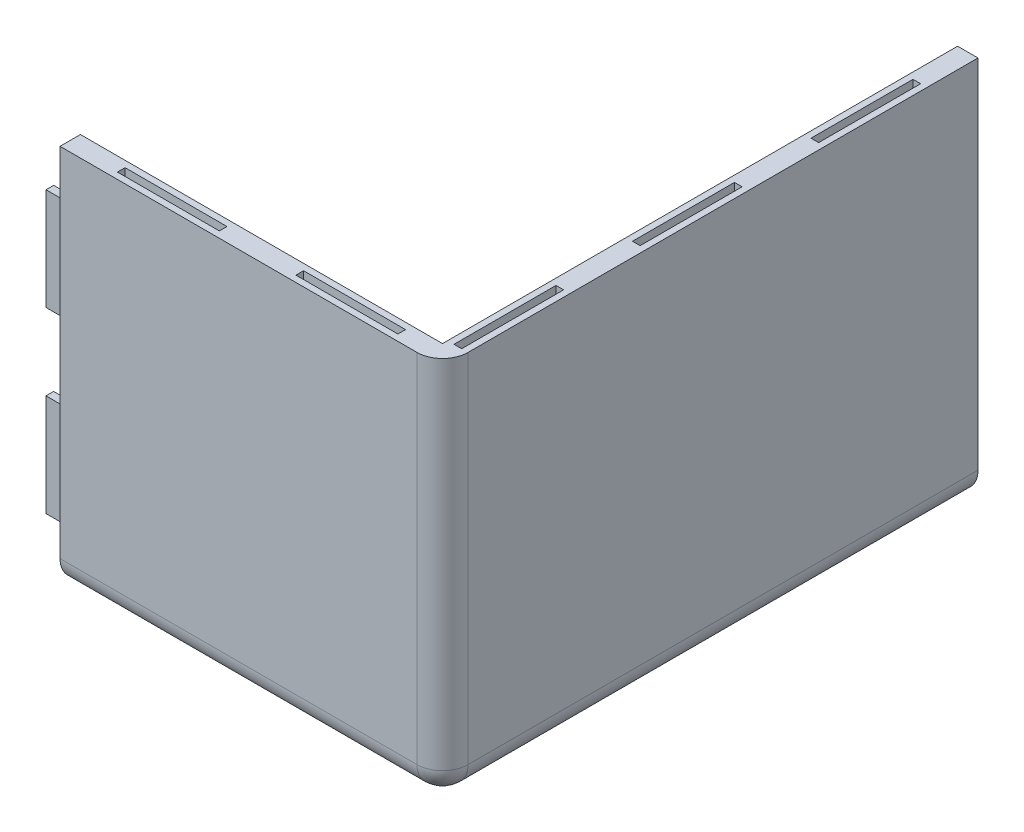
ISO-10303-21;
HEADER;
FILE_DESCRIPTION(('STEP AP214'),'2;1');
FILE_NAME('part.step','',(''),(''),'','','');
FILE_SCHEMA(('AUTOMOTIVE_DESIGN { 1 0 10303 214 1 1 1 1 }'));
ENDSEC;
DATA;
#1=APPLICATION_CONTEXT('core data for automotive mechanical design processes');
#2=APPLICATION_PROTOCOL_DEFINITION('international standard','automotive_design',2000,#1);
#3=PRODUCT_CONTEXT('',#1,'mechanical');
#4=PRODUCT('Part','Part','',(#3));
#5=PRODUCT_RELATED_PRODUCT_CATEGORY('part','',(#4));
#6=PRODUCT_DEFINITION_FORMATION('','',#4);
#7=PRODUCT_DEFINITION_CONTEXT('part definition',#1,'design');
#8=PRODUCT_DEFINITION('design','',#6,#7);
#9=PRODUCT_DEFINITION_SHAPE('','',#8);
#10=(LENGTH_UNIT() NAMED_UNIT(*) SI_UNIT(.MILLI.,.METRE.));
#11=(NAMED_UNIT(*) PLANE_ANGLE_UNIT() SI_UNIT($,.RADIAN.));
#12=(NAMED_UNIT(*) SI_UNIT($,.STERADIAN.) SOLID_ANGLE_UNIT());
#13=UNCERTAINTY_MEASURE_WITH_UNIT(LENGTH_MEASURE(1.E-05),#10,'distance_accuracy_value','');
#14=(GEOMETRIC_REPRESENTATION_CONTEXT(3) GLOBAL_UNCERTAINTY_ASSIGNED_CONTEXT((#13)) GLOBAL_UNIT_ASSIGNED_CONTEXT((#10,
#11,#12)) REPRESENTATION_CONTEXT('',''));
#15=CARTESIAN_POINT('',(0.,0.,0.));
#16=DIRECTION('',(0.,0.,1.));
#17=DIRECTION('',(1.,0.,0.));
#18=AXIS2_PLACEMENT_3D('',#15,#16,#17);
#19=CARTESIAN_POINT('',(0.,150.,0.));
#20=DIRECTION('',(1.,0.,0.));
#21=DIRECTION('',(0.,0.,-1.));
#22=AXIS2_PLACEMENT_3D('',#19,#20,#21);
#23=PLANE('',#22);
#24=DIRECTION('',(0.,-1.,0.));
#25=VECTOR('',#24,1.);
#26=CARTESIAN_POINT('',(0.,130.,-5.5));
#27=LINE('',#26,#25);
#28=CARTESIAN_POINT('',(0.,130.,-5.5));
#29=VERTEX_POINT('',#28);
#30=CARTESIAN_POINT('',(0.,90.,-5.5));
#31=VERTEX_POINT('',#30);
#32=EDGE_CURVE('E853',#29,#31,#27,.T.);
#33=ORIENTED_EDGE('',*,*,#32,.F.);
#34=DIRECTION('',(0.,0.,-1.));
#35=VECTOR('',#34,1.);
#36=CARTESIAN_POINT('',(0.,130.,-5.5));
#37=LINE('',#36,#35);
#38=CARTESIAN_POINT('',(0.,130.,-2.5));
#39=VERTEX_POINT('',#38);
#40=EDGE_CURVE('E840',#39,#29,#37,.T.);
#41=ORIENTED_EDGE('',*,*,#40,.F.);
#42=DIRECTION('',(0.,1.,0.));
#43=VECTOR('',#42,1.);
#44=CARTESIAN_POINT('',(0.,130.,-2.5));
#45=LINE('',#44,#43);
#46=CARTESIAN_POINT('',(0.,90.,-2.5));
#47=VERTEX_POINT('',#46);
#48=EDGE_CURVE('E844',#47,#39,#45,.T.);
#49=ORIENTED_EDGE('',*,*,#48,.F.);
#50=DIRECTION('',(0.,0.,1.));
#51=VECTOR('',#50,1.);
#52=CARTESIAN_POINT('',(0.,90.,-5.5));
#53=LINE('',#52,#51);
#54=EDGE_CURVE('E849',#31,#47,#53,.T.);
#55=ORIENTED_EDGE('',*,*,#54,.F.);
#56=EDGE_LOOP('',(#33,#41,#49,#55));
#57=FACE_BOUND('',#56,.T.);
#58=DIRECTION('',(0.,0.,1.));
#59=VECTOR('',#58,1.);
#60=CARTESIAN_POINT('',(0.,8.00000000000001,-210.));
#61=LINE('',#60,#59);
#62=CARTESIAN_POINT('',(0.,8.00000000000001,-80.));
#63=VERTEX_POINT('',#62);
#64=CARTESIAN_POINT('',(0.,8.00000000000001,-8.00000000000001));
#65=VERTEX_POINT('',#64);
#66=EDGE_CURVE('E916',#63,#65,#61,.T.);
#67=ORIENTED_EDGE('',*,*,#66,.F.);
#68=DIRECTION('',(0.,1.,0.));
#69=VECTOR('',#68,1.);
#70=CARTESIAN_POINT('',(0.,2.5,-80.));
#71=LINE('',#70,#69);
#72=CARTESIAN_POINT('',(0.,0.,-80.));
#73=VERTEX_POINT('',#72);
#74=EDGE_CURVE('E63',#73,#63,#71,.T.);
#75=ORIENTED_EDGE('',*,*,#74,.F.);
#76=DIRECTION('',(0.,0.,1.));
#77=VECTOR('',#76,1.);
#78=CARTESIAN_POINT('',(0.,0.,0.));
#79=LINE('',#78,#77);
#80=CARTESIAN_POINT('',(0.,0.,-10.));
#81=VERTEX_POINT('',#80);
#82=EDGE_CURVE('E418',#73,#81,#79,.T.);
#83=ORIENTED_EDGE('',*,*,#82,.T.);
#84=CARTESIAN_POINT('',(0.,10.,-10.));
#85=DIRECTION('',(1.,0.,0.));
#86=DIRECTION('',(0.,0.,-1.));
#87=AXIS2_PLACEMENT_3D('',#84,#85,#86);
#88=CIRCLE('',#87,10.);
#89=CARTESIAN_POINT('',(0.,10.,0.));
#90=VERTEX_POINT('',#89);
#91=EDGE_CURVE('E996',#81,#90,#88,.F.);
#92=ORIENTED_EDGE('',*,*,#91,.T.);
#93=DIRECTION('',(0.,-1.,0.));
#94=VECTOR('',#93,1.);
#95=CARTESIAN_POINT('',(0.,150.,0.));
#96=LINE('',#95,#94);
#97=CARTESIAN_POINT('',(0.,150.,0.));
#98=VERTEX_POINT('',#97);
#99=EDGE_CURVE('E970',#98,#90,#96,.T.);
#100=ORIENTED_EDGE('',*,*,#99,.F.);
#101=DIRECTION('',(0.,0.,1.));
#102=VECTOR('',#101,1.);
#103=CARTESIAN_POINT('',(0.,150.,0.));
#104=LINE('',#103,#102);
#105=CARTESIAN_POINT('',(0.,150.,-8.));
#106=VERTEX_POINT('',#105);
#107=EDGE_CURVE('E947',#106,#98,#104,.T.);
#108=ORIENTED_EDGE('',*,*,#107,.F.);
#109=DIRECTION('',(0.,1.,0.));
#110=VECTOR('',#109,1.);
#111=CARTESIAN_POINT('',(0.,8.00000000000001,-8.00000000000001));
#112=LINE('',#111,#110);
#113=EDGE_CURVE('E932',#65,#106,#112,.T.);
#114=ORIENTED_EDGE('',*,*,#113,.F.);
#115=EDGE_LOOP('',(#67,#75,#83,#92,#100,#108,#114));
#116=FACE_BOUND('',#115,.T.);
#117=DIRECTION('',(0.,-1.,0.));
#118=VECTOR('',#117,1.);
#119=CARTESIAN_POINT('',(0.,5.5,-50.));
#120=LINE('',#119,#118);
#121=CARTESIAN_POINT('',(0.,5.5,-50.));
#122=VERTEX_POINT('',#121);
#123=CARTESIAN_POINT('',(0.,2.5,-50.));
#124=VERTEX_POINT('',#123);
#125=EDGE_CURVE('E898',#122,#124,#120,.T.);
#126=ORIENTED_EDGE('',*,*,#125,.F.);
#127=DIRECTION('',(0.,0.,-1.));
#128=VECTOR('',#127,1.);
#129=CARTESIAN_POINT('',(0.,5.5,-50.));
#130=LINE('',#129,#128);
#131=CARTESIAN_POINT('',(0.,5.50000000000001,-9.99999999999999));
#132=VERTEX_POINT('',#131);
#133=EDGE_CURVE('E885',#132,#122,#130,.T.);
#134=ORIENTED_EDGE('',*,*,#133,.F.);
#135=DIRECTION('',(0.,1.,0.));
#136=VECTOR('',#135,1.);
#137=CARTESIAN_POINT('',(0.,5.5,-9.99999999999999));
#138=LINE('',#137,#136);
#139=CARTESIAN_POINT('',(0.,2.5,-9.99999999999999));
#140=VERTEX_POINT('',#139);
#141=EDGE_CURVE('E889',#140,#132,#138,.T.);
#142=ORIENTED_EDGE('',*,*,#141,.F.);
#143=DIRECTION('',(0.,0.,1.));
#144=VECTOR('',#143,1.);
#145=CARTESIAN_POINT('',(0.,2.5,-50.));
#146=LINE('',#145,#144);
#147=EDGE_CURVE('E894',#124,#140,#146,.T.);
#148=ORIENTED_EDGE('',*,*,#147,.F.);
#149=EDGE_LOOP('',(#126,#134,#142,#148));
#150=FACE_BOUND('',#149,.T.);
#151=DIRECTION('',(0.,-1.,0.));
#152=VECTOR('',#151,1.);
#153=CARTESIAN_POINT('',(0.,60.,-5.5));
#154=LINE('',#153,#152);
#155=CARTESIAN_POINT('',(0.,60.,-5.5));
#156=VERTEX_POINT('',#155);
#157=CARTESIAN_POINT('',(0.,20.,-5.49999999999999));
#158=VERTEX_POINT('',#157);
#159=EDGE_CURVE('E808',#156,#158,#154,.T.);
#160=ORIENTED_EDGE('',*,*,#159,.F.);
#161=DIRECTION('',(0.,0.,-1.));
#162=VECTOR('',#161,1.);
#163=CARTESIAN_POINT('',(0.,60.,-5.5));
#164=LINE('',#163,#162);
#165=CARTESIAN_POINT('',(0.,60.,-2.5));
#166=VERTEX_POINT('',#165);
#167=EDGE_CURVE('E795',#166,#156,#164,.T.);
#168=ORIENTED_EDGE('',*,*,#167,.F.);
#169=DIRECTION('',(0.,1.,0.));
#170=VECTOR('',#169,1.);
#171=CARTESIAN_POINT('',(0.,60.,-2.5));
#172=LINE('',#171,#170);
#173=CARTESIAN_POINT('',(0.,20.,-2.5));
#174=VERTEX_POINT('',#173);
#175=EDGE_CURVE('E799',#174,#166,#172,.T.);
#176=ORIENTED_EDGE('',*,*,#175,.F.);
#177=DIRECTION('',(0.,0.,1.));
#178=VECTOR('',#177,1.);
#179=CARTESIAN_POINT('',(0.,20.,-5.49999999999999));
#180=LINE('',#179,#178);
#181=EDGE_CURVE('E804',#158,#174,#180,.T.);
#182=ORIENTED_EDGE('',*,*,#181,.F.);
#183=EDGE_LOOP('',(#160,#168,#176,#182));
#184=FACE_BOUND('',#183,.T.);
#185=ADVANCED_FACE('F47',(#57,#116,#150,#184),#23,.F.);
#186=CARTESIAN_POINT('',(0.,150.,0.));
#187=DIRECTION('',(0.,0.,-1.));
#188=DIRECTION('',(-1.,0.,0.));
#189=AXIS2_PLACEMENT_3D('',#186,#187,#188);
#190=PLANE('',#189);
#191=ORIENTED_EDGE('',*,*,#99,.T.);
#192=DIRECTION('',(1.,0.,0.));
#193=VECTOR('',#192,1.);
#194=CARTESIAN_POINT('',(150.,10.,0.));
#195=LINE('',#194,#193);
#196=CARTESIAN_POINT('',(140.,10.,0.));
#197=VERTEX_POINT('',#196);
#198=EDGE_CURVE('E993',#90,#197,#195,.T.);
#199=ORIENTED_EDGE('',*,*,#198,.T.);
#200=DIRECTION('',(0.,-1.,0.));
#201=VECTOR('',#200,1.);
#202=CARTESIAN_POINT('',(140.,150.,0.));
#203=LINE('',#202,#201);
#204=CARTESIAN_POINT('',(140.,150.,0.));
#205=VERTEX_POINT('',#204);
#206=EDGE_CURVE('E990',#197,#205,#203,.F.);
#207=ORIENTED_EDGE('',*,*,#206,.T.);
#208=DIRECTION('',(1.,0.,0.));
#209=VECTOR('',#208,1.);
#210=CARTESIAN_POINT('',(0.,150.,0.));
#211=LINE('',#210,#209);
#212=EDGE_CURVE('E950',#98,#205,#211,.T.);
#213=ORIENTED_EDGE('',*,*,#212,.F.);
#214=EDGE_LOOP('',(#191,#199,#207,#213));
#215=FACE_BOUND('',#214,.T.);
#216=ADVANCED_FACE('F1040',(#215),#190,.F.);
#217=CARTESIAN_POINT('',(150.,150.,0.));
#218=DIRECTION('',(-1.,0.,0.));
#219=DIRECTION('',(0.,0.,1.));
#220=AXIS2_PLACEMENT_3D('',#217,#218,#219);
#221=PLANE('',#220);
#222=DIRECTION('',(0.,-1.,0.));
#223=VECTOR('',#222,1.);
#224=CARTESIAN_POINT('',(150.,150.,-10.));
#225=LINE('',#224,#223);
#226=CARTESIAN_POINT('',(150.,150.,-10.));
#227=VERTEX_POINT('',#226);
#228=CARTESIAN_POINT('',(150.,10.,-10.));
#229=VERTEX_POINT('',#228);
#230=EDGE_CURVE('E974',#227,#229,#225,.T.);
#231=ORIENTED_EDGE('',*,*,#230,.T.);
#232=DIRECTION('',(0.,0.,-1.));
#233=VECTOR('',#232,1.);
#234=CARTESIAN_POINT('',(150.,10.,-210.));
#235=LINE('',#234,#233);
#236=CARTESIAN_POINT('',(150.,10.,-210.));
#237=VERTEX_POINT('',#236);
#238=EDGE_CURVE('E977',#229,#237,#235,.T.);
#239=ORIENTED_EDGE('',*,*,#238,.T.);
#240=DIRECTION('',(0.,-1.,0.));
#241=VECTOR('',#240,1.);
#242=CARTESIAN_POINT('',(150.,150.,-210.));
#243=LINE('',#242,#241);
#244=CARTESIAN_POINT('',(150.,150.,-210.));
#245=VERTEX_POINT('',#244);
#246=EDGE_CURVE('E962',#245,#237,#243,.T.);
#247=ORIENTED_EDGE('',*,*,#246,.F.);
#248=DIRECTION('',(0.,0.,-1.));
#249=VECTOR('',#248,1.);
#250=CARTESIAN_POINT('',(150.,150.,0.));
#251=LINE('',#250,#249);
#252=EDGE_CURVE('E955',#227,#245,#251,.T.);
#253=ORIENTED_EDGE('',*,*,#252,.F.);
#254=EDGE_LOOP('',(#231,#239,#247,#253));
#255=FACE_BOUND('',#254,.T.);
#256=ADVANCED_FACE('F1023',(#255),#221,.F.);
#257=CARTESIAN_POINT('',(0.,150.,-210.));
#258=DIRECTION('',(0.,0.,1.));
#259=DIRECTION('',(1.,0.,0.));
#260=AXIS2_PLACEMENT_3D('',#257,#258,#259);
#261=PLANE('',#260);
#262=DIRECTION('',(-1.,0.,0.));
#263=VECTOR('',#262,1.);
#264=CARTESIAN_POINT('',(147.5,90.,-210.));
#265=LINE('',#264,#263);
#266=CARTESIAN_POINT('',(147.5,90.,-210.));
#267=VERTEX_POINT('',#266);
#268=CARTESIAN_POINT('',(144.5,90.,-210.));
#269=VERTEX_POINT('',#268);
#270=EDGE_CURVE('E666',#267,#269,#265,.T.);
#271=ORIENTED_EDGE('',*,*,#270,.F.);
#272=DIRECTION('',(0.,-1.,0.));
#273=VECTOR('',#272,1.);
#274=CARTESIAN_POINT('',(147.5,130.,-210.));
#275=LINE('',#274,#273);
#276=CARTESIAN_POINT('',(147.5,130.,-210.));
#277=VERTEX_POINT('',#276);
#278=EDGE_CURVE('E663',#277,#267,#275,.T.);
#279=ORIENTED_EDGE('',*,*,#278,.F.);
#280=DIRECTION('',(1.,0.,0.));
#281=VECTOR('',#280,1.);
#282=CARTESIAN_POINT('',(147.5,130.,-210.));
#283=LINE('',#282,#281);
#284=CARTESIAN_POINT('',(144.5,130.,-210.));
#285=VERTEX_POINT('',#284);
#286=EDGE_CURVE('E650',#285,#277,#283,.T.);
#287=ORIENTED_EDGE('',*,*,#286,.F.);
#288=DIRECTION('',(0.,1.,0.));
#289=VECTOR('',#288,1.);
#290=CARTESIAN_POINT('',(144.5,130.,-210.));
#291=LINE('',#290,#289);
#292=EDGE_CURVE('E671',#269,#285,#291,.T.);
#293=ORIENTED_EDGE('',*,*,#292,.F.);
#294=EDGE_LOOP('',(#271,#279,#287,#293));
#295=FACE_BOUND('',#294,.T.);
#296=DIRECTION('',(-1.,0.,0.));
#297=VECTOR('',#296,1.);
#298=CARTESIAN_POINT('',(147.5,20.,-210.));
#299=LINE('',#298,#297);
#300=CARTESIAN_POINT('',(147.5,20.,-210.));
#301=VERTEX_POINT('',#300);
#302=CARTESIAN_POINT('',(144.5,20.,-210.));
#303=VERTEX_POINT('',#302);
#304=EDGE_CURVE('E715',#301,#303,#299,.T.);
#305=ORIENTED_EDGE('',*,*,#304,.F.);
#306=DIRECTION('',(0.,-1.,0.));
#307=VECTOR('',#306,1.);
#308=CARTESIAN_POINT('',(147.5,60.,-210.));
#309=LINE('',#308,#307);
#310=CARTESIAN_POINT('',(147.5,60.,-210.));
#311=VERTEX_POINT('',#310);
#312=EDGE_CURVE('E667',#311,#301,#309,.T.);
#313=ORIENTED_EDGE('',*,*,#312,.F.);
#314=DIRECTION('',(1.,0.,0.));
#315=VECTOR('',#314,1.);
#316=CARTESIAN_POINT('',(147.5,60.,-210.));
#317=LINE('',#316,#315);
#318=CARTESIAN_POINT('',(144.5,60.,-210.));
#319=VERTEX_POINT('',#318);
#320=EDGE_CURVE('E706',#319,#311,#317,.T.);
#321=ORIENTED_EDGE('',*,*,#320,.F.);
#322=DIRECTION('',(0.,1.,0.));
#323=VECTOR('',#322,1.);
#324=CARTESIAN_POINT('',(144.5,60.,-210.));
#325=LINE('',#324,#323);
#326=EDGE_CURVE('E710',#303,#319,#325,.T.);
#327=ORIENTED_EDGE('',*,*,#326,.F.);
#328=EDGE_LOOP('',(#305,#313,#321,#327));
#329=FACE_BOUND('',#328,.T.);
#330=DIRECTION('',(-1.,0.,0.));
#331=VECTOR('',#330,1.);
#332=CARTESIAN_POINT('',(130.,2.5,-210.));
#333=LINE('',#332,#331);
#334=CARTESIAN_POINT('',(130.,2.5,-210.));
#335=VERTEX_POINT('',#334);
#336=CARTESIAN_POINT('',(90.,2.5,-210.));
#337=VERTEX_POINT('',#336);
#338=EDGE_CURVE('E759',#335,#337,#333,.T.);
#339=ORIENTED_EDGE('',*,*,#338,.F.);
#340=DIRECTION('',(0.,-1.,0.));
#341=VECTOR('',#340,1.);
#342=CARTESIAN_POINT('',(130.,5.5,-210.));
#343=LINE('',#342,#341);
#344=CARTESIAN_POINT('',(130.,5.5,-210.));
#345=VERTEX_POINT('',#344);
#346=EDGE_CURVE('E705',#345,#335,#343,.T.);
#347=ORIENTED_EDGE('',*,*,#346,.F.);
#348=DIRECTION('',(1.,0.,0.));
#349=VECTOR('',#348,1.);
#350=CARTESIAN_POINT('',(130.,5.5,-210.));
#351=LINE('',#350,#349);
#352=CARTESIAN_POINT('',(90.,5.50000000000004,-210.));
#353=VERTEX_POINT('',#352);
#354=EDGE_CURVE('E750',#353,#345,#351,.T.);
#355=ORIENTED_EDGE('',*,*,#354,.F.);
#356=DIRECTION('',(0.,1.,0.));
#357=VECTOR('',#356,1.);
#358=CARTESIAN_POINT('',(90.,5.50000000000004,-210.));
#359=LINE('',#358,#357);
#360=EDGE_CURVE('E754',#337,#353,#359,.T.);
#361=ORIENTED_EDGE('',*,*,#360,.F.);
#362=EDGE_LOOP('',(#339,#347,#355,#361));
#363=FACE_BOUND('',#362,.T.);
#364=DIRECTION('',(-1.,0.,0.));
#365=VECTOR('',#364,1.);
#366=CARTESIAN_POINT('',(0.,0.,-210.));
#367=LINE('',#366,#365);
#368=CARTESIAN_POINT('',(140.,0.,-210.));
#369=VERTEX_POINT('',#368);
#370=CARTESIAN_POINT('',(80.,0.,-210.));
#371=VERTEX_POINT('',#370);
#372=EDGE_CURVE('E951',#369,#371,#367,.T.);
#373=ORIENTED_EDGE('',*,*,#372,.T.);
#374=DIRECTION('',(0.,-1.,0.));
#375=VECTOR('',#374,1.);
#376=CARTESIAN_POINT('',(80.,10.,-210.));
#377=LINE('',#376,#375);
#378=CARTESIAN_POINT('',(80.,8.00000000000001,-210.));
#379=VERTEX_POINT('',#378);
#380=EDGE_CURVE('E405',#379,#371,#377,.T.);
#381=ORIENTED_EDGE('',*,*,#380,.F.);
#382=DIRECTION('',(-1.,0.,0.));
#383=VECTOR('',#382,1.);
#384=CARTESIAN_POINT('',(0.,8.00000000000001,-210.));
#385=LINE('',#384,#383);
#386=CARTESIAN_POINT('',(142.,8.00000000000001,-210.));
#387=VERTEX_POINT('',#386);
#388=EDGE_CURVE('E928',#387,#379,#385,.T.);
#389=ORIENTED_EDGE('',*,*,#388,.F.);
#390=DIRECTION('',(0.,1.,0.));
#391=VECTOR('',#390,1.);
#392=CARTESIAN_POINT('',(142.,8.00000000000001,-210.));
#393=LINE('',#392,#391);
#394=CARTESIAN_POINT('',(142.,150.,-210.));
#395=VERTEX_POINT('',#394);
#396=EDGE_CURVE('E938',#387,#395,#393,.T.);
#397=ORIENTED_EDGE('',*,*,#396,.T.);
#398=DIRECTION('',(-1.,0.,0.));
#399=VECTOR('',#398,1.);
#400=CARTESIAN_POINT('',(0.,150.,-210.));
#401=LINE('',#400,#399);
#402=EDGE_CURVE('E958',#245,#395,#401,.T.);
#403=ORIENTED_EDGE('',*,*,#402,.F.);
#404=ORIENTED_EDGE('',*,*,#246,.T.);
#405=CARTESIAN_POINT('',(140.,10.,-210.));
#406=DIRECTION('',(0.,0.,1.));
#407=DIRECTION('',(1.,0.,0.));
#408=AXIS2_PLACEMENT_3D('',#405,#406,#407);
#409=CIRCLE('',#408,10.);
#410=EDGE_CURVE('E981',#237,#369,#409,.F.);
#411=ORIENTED_EDGE('',*,*,#410,.T.);
#412=EDGE_LOOP('',(#373,#381,#389,#397,#403,#404,#411));
#413=FACE_BOUND('',#412,.T.);
#414=ADVANCED_FACE('F1028',(#295,#329,#363,#413),#261,.F.);
#415=CARTESIAN_POINT('',(0.,150.,0.));
#416=DIRECTION('',(0.,-1.,0.));
#417=DIRECTION('',(0.,0.,-1.));
#418=AXIS2_PLACEMENT_3D('',#415,#416,#417);
#419=PLANE('',#418);
#420=DIRECTION('',(1.,0.,0.));
#421=VECTOR('',#420,1.);
#422=CARTESIAN_POINT('',(20.,150.,-2.5));
#423=LINE('',#422,#421);
#424=CARTESIAN_POINT('',(20.,150.,-2.5));
#425=VERTEX_POINT('',#424);
#426=CARTESIAN_POINT('',(60.,150.,-2.5));
#427=VERTEX_POINT('',#426);
#428=EDGE_CURVE('E447',#425,#427,#423,.T.);
#429=ORIENTED_EDGE('',*,*,#428,.F.);
#430=DIRECTION('',(0.,0.,1.));
#431=VECTOR('',#430,1.);
#432=CARTESIAN_POINT('',(20.,150.,-5.5));
#433=LINE('',#432,#431);
#434=CARTESIAN_POINT('',(20.,150.,-5.5));
#435=VERTEX_POINT('',#434);
#436=EDGE_CURVE('E71',#435,#425,#433,.T.);
#437=ORIENTED_EDGE('',*,*,#436,.F.);
#438=DIRECTION('',(-1.,0.,0.));
#439=VECTOR('',#438,1.);
#440=CARTESIAN_POINT('',(20.,150.,-5.5));
#441=LINE('',#440,#439);
#442=CARTESIAN_POINT('',(60.,150.,-5.50000000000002));
#443=VERTEX_POINT('',#442);
#444=EDGE_CURVE('E432',#443,#435,#441,.T.);
#445=ORIENTED_EDGE('',*,*,#444,.F.);
#446=DIRECTION('',(0.,0.,-1.));
#447=VECTOR('',#446,1.);
#448=CARTESIAN_POINT('',(60.,150.,-5.50000000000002));
#449=LINE('',#448,#447);
#450=EDGE_CURVE('E452',#427,#443,#449,.T.);
#451=ORIENTED_EDGE('',*,*,#450,.F.);
#452=EDGE_LOOP('',(#429,#437,#445,#451));
#453=FACE_BOUND('',#452,.T.);
#454=DIRECTION('',(-1.,0.,0.));
#455=VECTOR('',#454,1.);
#456=CARTESIAN_POINT('',(147.5,150.,-50.));
#457=LINE('',#456,#455);
#458=CARTESIAN_POINT('',(147.5,150.,-50.));
#459=VERTEX_POINT('',#458);
#460=CARTESIAN_POINT('',(144.5,150.,-50.));
#461=VERTEX_POINT('',#460);
#462=EDGE_CURVE('E539',#459,#461,#457,.T.);
#463=ORIENTED_EDGE('',*,*,#462,.F.);
#464=DIRECTION('',(0.,0.,-1.));
#465=VECTOR('',#464,1.);
#466=CARTESIAN_POINT('',(147.5,150.,-50.));
#467=LINE('',#466,#465);
#468=CARTESIAN_POINT('',(147.5,150.,-9.99999999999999));
#469=VERTEX_POINT('',#468);
#470=EDGE_CURVE('E485',#469,#459,#467,.T.);
#471=ORIENTED_EDGE('',*,*,#470,.F.);
#472=DIRECTION('',(1.,0.,0.));
#473=VECTOR('',#472,1.);
#474=CARTESIAN_POINT('',(147.5,150.,-9.99999999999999));
#475=LINE('',#474,#473);
#476=CARTESIAN_POINT('',(144.5,150.,-9.99999999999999));
#477=VERTEX_POINT('',#476);
#478=EDGE_CURVE('E530',#477,#469,#475,.T.);
#479=ORIENTED_EDGE('',*,*,#478,.F.);
#480=DIRECTION('',(0.,0.,1.));
#481=VECTOR('',#480,1.);
#482=CARTESIAN_POINT('',(144.5,150.,-50.));
#483=LINE('',#482,#481);
#484=EDGE_CURVE('E534',#461,#477,#483,.T.);
#485=ORIENTED_EDGE('',*,*,#484,.F.);
#486=EDGE_LOOP('',(#463,#471,#479,#485));
#487=FACE_BOUND('',#486,.T.);
#488=DIRECTION('',(-1.,0.,0.));
#489=VECTOR('',#488,1.);
#490=CARTESIAN_POINT('',(147.5,150.,-120.));
#491=LINE('',#490,#489);
#492=CARTESIAN_POINT('',(147.5,150.,-120.));
#493=VERTEX_POINT('',#492);
#494=CARTESIAN_POINT('',(144.5,150.,-120.));
#495=VERTEX_POINT('',#494);
#496=EDGE_CURVE('E495',#493,#495,#491,.T.);
#497=ORIENTED_EDGE('',*,*,#496,.F.);
#498=DIRECTION('',(0.,0.,-1.));
#499=VECTOR('',#498,1.);
#500=CARTESIAN_POINT('',(147.5,150.,-120.));
#501=LINE('',#500,#499);
#502=CARTESIAN_POINT('',(147.5,150.,-80.));
#503=VERTEX_POINT('',#502);
#504=EDGE_CURVE('E499',#503,#493,#501,.T.);
#505=ORIENTED_EDGE('',*,*,#504,.F.);
#506=DIRECTION('',(1.,0.,0.));
#507=VECTOR('',#506,1.);
#508=CARTESIAN_POINT('',(147.5,150.,-80.));
#509=LINE('',#508,#507);
#510=CARTESIAN_POINT('',(144.5,150.,-80.));
#511=VERTEX_POINT('',#510);
#512=EDGE_CURVE('E486',#511,#503,#509,.T.);
#513=ORIENTED_EDGE('',*,*,#512,.F.);
#514=DIRECTION('',(0.,0.,1.));
#515=VECTOR('',#514,1.);
#516=CARTESIAN_POINT('',(144.5,150.,-120.));
#517=LINE('',#516,#515);
#518=EDGE_CURVE('E490',#495,#511,#517,.T.);
#519=ORIENTED_EDGE('',*,*,#518,.F.);
#520=EDGE_LOOP('',(#497,#505,#513,#519));
#521=FACE_BOUND('',#520,.T.);
#522=DIRECTION('',(1.,0.,0.));
#523=VECTOR('',#522,1.);
#524=CARTESIAN_POINT('',(144.5,150.,-150.));
#525=LINE('',#524,#523);
#526=CARTESIAN_POINT('',(144.5,150.,-150.));
#527=VERTEX_POINT('',#526);
#528=CARTESIAN_POINT('',(147.5,150.,-150.));
#529=VERTEX_POINT('',#528);
#530=EDGE_CURVE('E625',#527,#529,#525,.T.);
#531=ORIENTED_EDGE('',*,*,#530,.F.);
#532=DIRECTION('',(0.,0.,1.));
#533=VECTOR('',#532,1.);
#534=CARTESIAN_POINT('',(144.5,150.,-190.));
#535=LINE('',#534,#533);
#536=CARTESIAN_POINT('',(144.5,150.,-190.));
#537=VERTEX_POINT('',#536);
#538=EDGE_CURVE('E573',#537,#527,#535,.T.);
#539=ORIENTED_EDGE('',*,*,#538,.F.);
#540=DIRECTION('',(-1.,0.,0.));
#541=VECTOR('',#540,1.);
#542=CARTESIAN_POINT('',(144.5,150.,-190.));
#543=LINE('',#542,#541);
#544=CARTESIAN_POINT('',(147.5,150.,-190.));
#545=VERTEX_POINT('',#544);
#546=EDGE_CURVE('E616',#545,#537,#543,.T.);
#547=ORIENTED_EDGE('',*,*,#546,.F.);
#548=DIRECTION('',(0.,0.,-1.));
#549=VECTOR('',#548,1.);
#550=CARTESIAN_POINT('',(147.5,150.,-190.));
#551=LINE('',#550,#549);
#552=EDGE_CURVE('E620',#529,#545,#551,.T.);
#553=ORIENTED_EDGE('',*,*,#552,.F.);
#554=EDGE_LOOP('',(#531,#539,#547,#553));
#555=FACE_BOUND('',#554,.T.);
#556=DIRECTION('',(1.,0.,0.));
#557=VECTOR('',#556,1.);
#558=CARTESIAN_POINT('',(90.,150.,-2.50000000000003));
#559=LINE('',#558,#557);
#560=CARTESIAN_POINT('',(90.,150.,-2.50000000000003));
#561=VERTEX_POINT('',#560);
#562=CARTESIAN_POINT('',(130.,150.,-2.50000000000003));
#563=VERTEX_POINT('',#562);
#564=EDGE_CURVE('E583',#561,#563,#559,.T.);
#565=ORIENTED_EDGE('',*,*,#564,.F.);
#566=DIRECTION('',(0.,0.,1.));
#567=VECTOR('',#566,1.);
#568=CARTESIAN_POINT('',(90.,150.,-5.50000000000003));
#569=LINE('',#568,#567);
#570=CARTESIAN_POINT('',(90.,150.,-5.50000000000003));
#571=VERTEX_POINT('',#570);
#572=EDGE_CURVE('E448',#571,#561,#569,.T.);
#573=ORIENTED_EDGE('',*,*,#572,.F.);
#574=DIRECTION('',(-1.,0.,0.));
#575=VECTOR('',#574,1.);
#576=CARTESIAN_POINT('',(90.,150.,-5.50000000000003));
#577=LINE('',#576,#575);
#578=CARTESIAN_POINT('',(130.,150.,-5.50000000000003));
#579=VERTEX_POINT('',#578);
#580=EDGE_CURVE('E574',#579,#571,#577,.T.);
#581=ORIENTED_EDGE('',*,*,#580,.F.);
#582=DIRECTION('',(0.,0.,-1.));
#583=VECTOR('',#582,1.);
#584=CARTESIAN_POINT('',(130.,150.,-5.50000000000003));
#585=LINE('',#584,#583);
#586=EDGE_CURVE('E578',#563,#579,#585,.T.);
#587=ORIENTED_EDGE('',*,*,#586,.F.);
#588=EDGE_LOOP('',(#565,#573,#581,#587));
#589=FACE_BOUND('',#588,.T.);
#590=ORIENTED_EDGE('',*,*,#212,.T.);
#591=CARTESIAN_POINT('',(140.,150.,-10.));
#592=DIRECTION('',(0.,-1.,0.));
#593=DIRECTION('',(0.,0.,-1.));
#594=AXIS2_PLACEMENT_3D('',#591,#592,#593);
#595=CIRCLE('',#594,10.);
#596=EDGE_CURVE('E56',#205,#227,#595,.F.);
#597=ORIENTED_EDGE('',*,*,#596,.T.);
#598=ORIENTED_EDGE('',*,*,#252,.T.);
#599=ORIENTED_EDGE('',*,*,#402,.T.);
#600=DIRECTION('',(0.,0.,-1.));
#601=VECTOR('',#600,1.);
#602=CARTESIAN_POINT('',(142.,150.,-210.));
#603=LINE('',#602,#601);
#604=CARTESIAN_POINT('',(142.,150.,-8.));
#605=VERTEX_POINT('',#604);
#606=EDGE_CURVE('E920',#605,#395,#603,.T.);
#607=ORIENTED_EDGE('',*,*,#606,.F.);
#608=DIRECTION('',(1.,0.,0.));
#609=VECTOR('',#608,1.);
#610=CARTESIAN_POINT('',(0.,150.,-8.00000000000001));
#611=LINE('',#610,#609);
#612=EDGE_CURVE('E915',#106,#605,#611,.T.);
#613=ORIENTED_EDGE('',*,*,#612,.F.);
#614=ORIENTED_EDGE('',*,*,#107,.T.);
#615=EDGE_LOOP('',(#590,#597,#598,#599,#607,#613,#614));
#616=FACE_BOUND('',#615,.T.);
#617=ADVANCED_FACE('F1032',(#453,#487,#521,#555,#589,#616),#419,.F.);
#618=CARTESIAN_POINT('',(0.,0.,0.));
#619=DIRECTION('',(0.,-1.,0.));
#620=DIRECTION('',(0.,0.,-1.));
#621=AXIS2_PLACEMENT_3D('',#618,#619,#620);
#622=PLANE('',#621);
#623=DIRECTION('',(0.,0.,1.));
#624=VECTOR('',#623,1.);
#625=CARTESIAN_POINT('',(80.,0.,-80.));
#626=LINE('',#625,#624);
#627=CARTESIAN_POINT('',(80.,0.,-80.));
#628=VERTEX_POINT('',#627);
#629=EDGE_CURVE('E408',#371,#628,#626,.T.);
#630=ORIENTED_EDGE('',*,*,#629,.F.);
#631=ORIENTED_EDGE('',*,*,#372,.F.);
#632=DIRECTION('',(0.,0.,-1.));
#633=VECTOR('',#632,1.);
#634=CARTESIAN_POINT('',(140.,0.,0.));
#635=LINE('',#634,#633);
#636=CARTESIAN_POINT('',(140.,0.,-10.));
#637=VERTEX_POINT('',#636);
#638=EDGE_CURVE('E987',#369,#637,#635,.F.);
#639=ORIENTED_EDGE('',*,*,#638,.T.);
#640=DIRECTION('',(1.,0.,0.));
#641=VECTOR('',#640,1.);
#642=CARTESIAN_POINT('',(0.,0.,-10.));
#643=LINE('',#642,#641);
#644=EDGE_CURVE('E984',#637,#81,#643,.F.);
#645=ORIENTED_EDGE('',*,*,#644,.T.);
#646=ORIENTED_EDGE('',*,*,#82,.F.);
#647=DIRECTION('',(-1.,0.,0.));
#648=VECTOR('',#647,1.);
#649=CARTESIAN_POINT('',(80.,0.,-80.));
#650=LINE('',#649,#648);
#651=EDGE_CURVE('E399',#628,#73,#650,.T.);
#652=ORIENTED_EDGE('',*,*,#651,.F.);
#653=EDGE_LOOP('',(#630,#631,#639,#645,#646,#652));
#654=FACE_BOUND('',#653,.T.);
#655=ADVANCED_FACE('F416',(#654),#622,.T.);
#656=CARTESIAN_POINT('',(142.,8.00000000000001,-210.));
#657=DIRECTION('',(1.,0.,0.));
#658=DIRECTION('',(0.,0.,-1.));
#659=AXIS2_PLACEMENT_3D('',#656,#657,#658);
#660=PLANE('',#659);
#661=ORIENTED_EDGE('',*,*,#606,.T.);
#662=ORIENTED_EDGE('',*,*,#396,.F.);
#663=DIRECTION('',(0.,0.,-1.));
#664=VECTOR('',#663,1.);
#665=CARTESIAN_POINT('',(142.,8.00000000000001,-210.));
#666=LINE('',#665,#664);
#667=CARTESIAN_POINT('',(142.,8.00000000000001,-8.));
#668=VERTEX_POINT('',#667);
#669=EDGE_CURVE('E924',#668,#387,#666,.T.);
#670=ORIENTED_EDGE('',*,*,#669,.F.);
#671=DIRECTION('',(0.,1.,0.));
#672=VECTOR('',#671,1.);
#673=CARTESIAN_POINT('',(142.,8.00000000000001,-8.));
#674=LINE('',#673,#672);
#675=EDGE_CURVE('E942',#668,#605,#674,.T.);
#676=ORIENTED_EDGE('',*,*,#675,.T.);
#677=EDGE_LOOP('',(#661,#662,#670,#676));
#678=FACE_BOUND('',#677,.T.);
#679=ADVANCED_FACE('F1053',(#678),#660,.F.);
#680=CARTESIAN_POINT('',(0.,8.00000000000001,-8.00000000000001));
#681=DIRECTION('',(0.,0.,1.));
#682=DIRECTION('',(1.,0.,0.));
#683=AXIS2_PLACEMENT_3D('',#680,#681,#682);
#684=PLANE('',#683);
#685=ORIENTED_EDGE('',*,*,#612,.T.);
#686=ORIENTED_EDGE('',*,*,#675,.F.);
#687=DIRECTION('',(1.,0.,0.));
#688=VECTOR('',#687,1.);
#689=CARTESIAN_POINT('',(0.,8.00000000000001,-8.00000000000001));
#690=LINE('',#689,#688);
#691=EDGE_CURVE('E919',#65,#668,#690,.T.);
#692=ORIENTED_EDGE('',*,*,#691,.F.);
#693=ORIENTED_EDGE('',*,*,#113,.T.);
#694=EDGE_LOOP('',(#685,#686,#692,#693));
#695=FACE_BOUND('',#694,.T.);
#696=ADVANCED_FACE('F1055',(#695),#684,.F.);
#697=CARTESIAN_POINT('',(0.,8.00000000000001,0.));
#698=DIRECTION('',(0.,1.,0.));
#699=DIRECTION('',(0.,0.,1.));
#700=AXIS2_PLACEMENT_3D('',#697,#698,#699);
#701=PLANE('',#700);
#702=DIRECTION('',(0.,0.,-1.));
#703=VECTOR('',#702,1.);
#704=CARTESIAN_POINT('',(80.,8.00000000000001,0.));
#705=LINE('',#704,#703);
#706=CARTESIAN_POINT('',(80.,8.00000000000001,-80.));
#707=VERTEX_POINT('',#706);
#708=EDGE_CURVE('E11',#707,#379,#705,.T.);
#709=ORIENTED_EDGE('',*,*,#708,.F.);
#710=DIRECTION('',(1.,0.,0.));
#711=VECTOR('',#710,1.);
#712=CARTESIAN_POINT('',(0.,8.00000000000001,-80.));
#713=LINE('',#712,#711);
#714=EDGE_CURVE('E401',#63,#707,#713,.T.);
#715=ORIENTED_EDGE('',*,*,#714,.F.);
#716=ORIENTED_EDGE('',*,*,#66,.T.);
#717=ORIENTED_EDGE('',*,*,#691,.T.);
#718=ORIENTED_EDGE('',*,*,#669,.T.);
#719=ORIENTED_EDGE('',*,*,#388,.T.);
#720=EDGE_LOOP('',(#709,#715,#716,#717,#718,#719));
#721=FACE_BOUND('',#720,.T.);
#722=ADVANCED_FACE('F1049',(#721),#701,.T.);
#723=CARTESIAN_POINT('',(-8.,5.5,-50.));
#724=DIRECTION('',(0.,0.,1.));
#725=DIRECTION('',(1.,0.,0.));
#726=AXIS2_PLACEMENT_3D('',#723,#724,#725);
#727=PLANE('',#726);
#728=ORIENTED_EDGE('',*,*,#125,.T.);
#729=DIRECTION('',(1.,0.,0.));
#730=VECTOR('',#729,1.);
#731=CARTESIAN_POINT('',(-8.,2.5,-50.));
#732=LINE('',#731,#730);
#733=CARTESIAN_POINT('',(-8.,2.5,-50.));
#734=VERTEX_POINT('',#733);
#735=EDGE_CURVE('E857',#734,#124,#732,.T.);
#736=ORIENTED_EDGE('',*,*,#735,.F.);
#737=DIRECTION('',(0.,-1.,0.));
#738=VECTOR('',#737,1.);
#739=CARTESIAN_POINT('',(-8.,5.5,-50.));
#740=LINE('',#739,#738);
#741=CARTESIAN_POINT('',(-8.,5.5,-50.));
#742=VERTEX_POINT('',#741);
#743=EDGE_CURVE('E890',#742,#734,#740,.T.);
#744=ORIENTED_EDGE('',*,*,#743,.F.);
#745=DIRECTION('',(1.,0.,0.));
#746=VECTOR('',#745,1.);
#747=CARTESIAN_POINT('',(-8.,5.5,-50.));
#748=LINE('',#747,#746);
#749=EDGE_CURVE('E880',#742,#122,#748,.T.);
#750=ORIENTED_EDGE('',*,*,#749,.T.);
#751=EDGE_LOOP('',(#728,#736,#744,#750));
#752=FACE_BOUND('',#751,.T.);
#753=ADVANCED_FACE('F1063',(#752),#727,.F.);
#754=CARTESIAN_POINT('',(-8.,2.5,-50.));
#755=DIRECTION('',(0.,1.,0.));
#756=DIRECTION('',(0.,0.,1.));
#757=AXIS2_PLACEMENT_3D('',#754,#755,#756);
#758=PLANE('',#757);
#759=ORIENTED_EDGE('',*,*,#147,.T.);
#760=DIRECTION('',(1.,0.,0.));
#761=VECTOR('',#760,1.);
#762=CARTESIAN_POINT('',(-8.,2.5,-9.99999999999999));
#763=LINE('',#762,#761);
#764=CARTESIAN_POINT('',(-8.,2.5,-9.99999999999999));
#765=VERTEX_POINT('',#764);
#766=EDGE_CURVE('E872',#765,#140,#763,.T.);
#767=ORIENTED_EDGE('',*,*,#766,.F.);
#768=DIRECTION('',(0.,0.,1.));
#769=VECTOR('',#768,1.);
#770=CARTESIAN_POINT('',(-8.,2.5,-50.));
#771=LINE('',#770,#769);
#772=EDGE_CURVE('E907',#734,#765,#771,.T.);
#773=ORIENTED_EDGE('',*,*,#772,.F.);
#774=ORIENTED_EDGE('',*,*,#735,.T.);
#775=EDGE_LOOP('',(#759,#767,#773,#774));
#776=FACE_BOUND('',#775,.T.);
#777=ADVANCED_FACE('F1197',(#776),#758,.F.);
#778=CARTESIAN_POINT('',(-8.,5.5,-9.99999999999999));
#779=DIRECTION('',(0.,0.,-1.));
#780=DIRECTION('',(-1.,0.,0.));
#781=AXIS2_PLACEMENT_3D('',#778,#779,#780);
#782=PLANE('',#781);
#783=ORIENTED_EDGE('',*,*,#141,.T.);
#784=DIRECTION('',(1.,0.,0.));
#785=VECTOR('',#784,1.);
#786=CARTESIAN_POINT('',(-8.,5.5,-9.99999999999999));
#787=LINE('',#786,#785);
#788=CARTESIAN_POINT('',(-8.,5.5,-9.99999999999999));
#789=VERTEX_POINT('',#788);
#790=EDGE_CURVE('E876',#789,#132,#787,.T.);
#791=ORIENTED_EDGE('',*,*,#790,.F.);
#792=DIRECTION('',(0.,1.,0.));
#793=VECTOR('',#792,1.);
#794=CARTESIAN_POINT('',(-8.,5.5,-9.99999999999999));
#795=LINE('',#794,#793);
#796=EDGE_CURVE('E904',#765,#789,#795,.T.);
#797=ORIENTED_EDGE('',*,*,#796,.F.);
#798=ORIENTED_EDGE('',*,*,#766,.T.);
#799=EDGE_LOOP('',(#783,#791,#797,#798));
#800=FACE_BOUND('',#799,.T.);
#801=ADVANCED_FACE('F1201',(#800),#782,.F.);
#802=CARTESIAN_POINT('',(-8.,5.5,-50.));
#803=DIRECTION('',(0.,-1.,0.));
#804=DIRECTION('',(0.,0.,-1.));
#805=AXIS2_PLACEMENT_3D('',#802,#803,#804);
#806=PLANE('',#805);
#807=ORIENTED_EDGE('',*,*,#133,.T.);
#808=ORIENTED_EDGE('',*,*,#749,.F.);
#809=DIRECTION('',(0.,0.,-1.));
#810=VECTOR('',#809,1.);
#811=CARTESIAN_POINT('',(-8.,5.5,-50.));
#812=LINE('',#811,#810);
#813=EDGE_CURVE('E884',#789,#742,#812,.T.);
#814=ORIENTED_EDGE('',*,*,#813,.F.);
#815=ORIENTED_EDGE('',*,*,#790,.T.);
#816=EDGE_LOOP('',(#807,#808,#814,#815));
#817=FACE_BOUND('',#816,.T.);
#818=ADVANCED_FACE('F1205',(#817),#806,.F.);
#819=CARTESIAN_POINT('',(-8.,0.,0.));
#820=DIRECTION('',(-1.,0.,0.));
#821=DIRECTION('',(0.,0.,1.));
#822=AXIS2_PLACEMENT_3D('',#819,#820,#821);
#823=PLANE('',#822);
#824=ORIENTED_EDGE('',*,*,#743,.T.);
#825=ORIENTED_EDGE('',*,*,#772,.T.);
#826=ORIENTED_EDGE('',*,*,#796,.T.);
#827=ORIENTED_EDGE('',*,*,#813,.T.);
#828=EDGE_LOOP('',(#824,#825,#826,#827));
#829=FACE_BOUND('',#828,.T.);
#830=ADVANCED_FACE('F1180',(#829),#823,.T.);
#831=CARTESIAN_POINT('',(-8.,130.,-5.5));
#832=DIRECTION('',(0.,0.,1.));
#833=DIRECTION('',(0.,-1.,0.));
#834=AXIS2_PLACEMENT_3D('',#831,#832,#833);
#835=PLANE('',#834);
#836=ORIENTED_EDGE('',*,*,#32,.T.);
#837=DIRECTION('',(1.,0.,0.));
#838=VECTOR('',#837,1.);
#839=CARTESIAN_POINT('',(-8.,90.,-5.5));
#840=LINE('',#839,#838);
#841=CARTESIAN_POINT('',(-8.,90.,-5.5));
#842=VERTEX_POINT('',#841);
#843=EDGE_CURVE('E812',#842,#31,#840,.T.);
#844=ORIENTED_EDGE('',*,*,#843,.F.);
#845=DIRECTION('',(0.,-1.,0.));
#846=VECTOR('',#845,1.);
#847=CARTESIAN_POINT('',(-8.,130.,-5.5));
#848=LINE('',#847,#846);
#849=CARTESIAN_POINT('',(-8.,130.,-5.5));
#850=VERTEX_POINT('',#849);
#851=EDGE_CURVE('E845',#850,#842,#848,.T.);
#852=ORIENTED_EDGE('',*,*,#851,.F.);
#853=DIRECTION('',(1.,0.,0.));
#854=VECTOR('',#853,1.);
#855=CARTESIAN_POINT('',(-8.,130.,-5.5));
#856=LINE('',#855,#854);
#857=EDGE_CURVE('E835',#850,#29,#856,.T.);
#858=ORIENTED_EDGE('',*,*,#857,.T.);
#859=EDGE_LOOP('',(#836,#844,#852,#858));
#860=FACE_BOUND('',#859,.T.);
#861=ADVANCED_FACE('F1176',(#860),#835,.F.);
#862=CARTESIAN_POINT('',(-8.,90.,-5.5));
#863=DIRECTION('',(0.,1.,0.));
#864=DIRECTION('',(0.,0.,1.));
#865=AXIS2_PLACEMENT_3D('',#862,#863,#864);
#866=PLANE('',#865);
#867=ORIENTED_EDGE('',*,*,#54,.T.);
#868=DIRECTION('',(1.,0.,0.));
#869=VECTOR('',#868,1.);
#870=CARTESIAN_POINT('',(-8.,90.,-2.5));
#871=LINE('',#870,#869);
#872=CARTESIAN_POINT('',(-8.,90.,-2.5));
#873=VERTEX_POINT('',#872);
#874=EDGE_CURVE('E827',#873,#47,#871,.T.);
#875=ORIENTED_EDGE('',*,*,#874,.F.);
#876=DIRECTION('',(0.,0.,1.));
#877=VECTOR('',#876,1.);
#878=CARTESIAN_POINT('',(-8.,90.,-5.5));
#879=LINE('',#878,#877);
#880=EDGE_CURVE('E863',#842,#873,#879,.T.);
#881=ORIENTED_EDGE('',*,*,#880,.F.);
#882=ORIENTED_EDGE('',*,*,#843,.T.);
#883=EDGE_LOOP('',(#867,#875,#881,#882));
#884=FACE_BOUND('',#883,.T.);
#885=ADVANCED_FACE('F1179',(#884),#866,.F.);
#886=CARTESIAN_POINT('',(-8.,130.,-2.5));
#887=DIRECTION('',(0.,0.,-1.));
#888=DIRECTION('',(0.,1.,0.));
#889=AXIS2_PLACEMENT_3D('',#886,#887,#888);
#890=PLANE('',#889);
#891=ORIENTED_EDGE('',*,*,#48,.T.);
#892=DIRECTION('',(1.,0.,0.));
#893=VECTOR('',#892,1.);
#894=CARTESIAN_POINT('',(-8.,130.,-2.5));
#895=LINE('',#894,#893);
#896=CARTESIAN_POINT('',(-8.,130.,-2.5));
#897=VERTEX_POINT('',#896);
#898=EDGE_CURVE('E831',#897,#39,#895,.T.);
#899=ORIENTED_EDGE('',*,*,#898,.F.);
#900=DIRECTION('',(0.,1.,0.));
#901=VECTOR('',#900,1.);
#902=CARTESIAN_POINT('',(-8.,130.,-2.5));
#903=LINE('',#902,#901);
#904=EDGE_CURVE('E860',#873,#897,#903,.T.);
#905=ORIENTED_EDGE('',*,*,#904,.F.);
#906=ORIENTED_EDGE('',*,*,#874,.T.);
#907=EDGE_LOOP('',(#891,#899,#905,#906));
#908=FACE_BOUND('',#907,.T.);
#909=ADVANCED_FACE('F1184',(#908),#890,.F.);
#910=CARTESIAN_POINT('',(-8.,130.,-5.5));
#911=DIRECTION('',(0.,-1.,0.));
#912=DIRECTION('',(0.,0.,-1.));
#913=AXIS2_PLACEMENT_3D('',#910,#911,#912);
#914=PLANE('',#913);
#915=ORIENTED_EDGE('',*,*,#40,.T.);
#916=ORIENTED_EDGE('',*,*,#857,.F.);
#917=DIRECTION('',(0.,0.,-1.));
#918=VECTOR('',#917,1.);
#919=CARTESIAN_POINT('',(-8.,130.,-5.5));
#920=LINE('',#919,#918);
#921=EDGE_CURVE('E839',#897,#850,#920,.T.);
#922=ORIENTED_EDGE('',*,*,#921,.F.);
#923=ORIENTED_EDGE('',*,*,#898,.T.);
#924=EDGE_LOOP('',(#915,#916,#922,#923));
#925=FACE_BOUND('',#924,.T.);
#926=ADVANCED_FACE('F1188',(#925),#914,.F.);
#927=CARTESIAN_POINT('',(-8.,0.,0.));
#928=DIRECTION('',(-1.,0.,0.));
#929=DIRECTION('',(0.,0.,1.));
#930=AXIS2_PLACEMENT_3D('',#927,#928,#929);
#931=PLANE('',#930);
#932=ORIENTED_EDGE('',*,*,#851,.T.);
#933=ORIENTED_EDGE('',*,*,#880,.T.);
#934=ORIENTED_EDGE('',*,*,#904,.T.);
#935=ORIENTED_EDGE('',*,*,#921,.T.);
#936=EDGE_LOOP('',(#932,#933,#934,#935));
#937=FACE_BOUND('',#936,.T.);
#938=ADVANCED_FACE('F1160',(#937),#931,.T.);
#939=CARTESIAN_POINT('',(-8.,60.,-5.5));
#940=DIRECTION('',(0.,0.,1.));
#941=DIRECTION('',(0.,-1.,0.));
#942=AXIS2_PLACEMENT_3D('',#939,#940,#941);
#943=PLANE('',#942);
#944=ORIENTED_EDGE('',*,*,#159,.T.);
#945=DIRECTION('',(1.,0.,0.));
#946=VECTOR('',#945,1.);
#947=CARTESIAN_POINT('',(-8.,20.,-5.49999999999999));
#948=LINE('',#947,#946);
#949=CARTESIAN_POINT('',(-8.,20.,-5.49999999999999));
#950=VERTEX_POINT('',#949);
#951=EDGE_CURVE('E681',#950,#158,#948,.T.);
#952=ORIENTED_EDGE('',*,*,#951,.F.);
#953=DIRECTION('',(0.,-1.,0.));
#954=VECTOR('',#953,1.);
#955=CARTESIAN_POINT('',(-8.,60.,-5.5));
#956=LINE('',#955,#954);
#957=CARTESIAN_POINT('',(-8.,60.,-5.5));
#958=VERTEX_POINT('',#957);
#959=EDGE_CURVE('E800',#958,#950,#956,.T.);
#960=ORIENTED_EDGE('',*,*,#959,.F.);
#961=DIRECTION('',(1.,0.,0.));
#962=VECTOR('',#961,1.);
#963=CARTESIAN_POINT('',(-8.,60.,-5.5));
#964=LINE('',#963,#962);
#965=EDGE_CURVE('E790',#958,#156,#964,.T.);
#966=ORIENTED_EDGE('',*,*,#965,.T.);
#967=EDGE_LOOP('',(#944,#952,#960,#966));
#968=FACE_BOUND('',#967,.T.);
#969=ADVANCED_FACE('F1156',(#968),#943,.F.);
#970=CARTESIAN_POINT('',(-8.,20.,-5.49999999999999));
#971=DIRECTION('',(0.,1.,0.));
#972=DIRECTION('',(0.,0.,1.));
#973=AXIS2_PLACEMENT_3D('',#970,#971,#972);
#974=PLANE('',#973);
#975=ORIENTED_EDGE('',*,*,#181,.T.);
#976=DIRECTION('',(1.,0.,0.));
#977=VECTOR('',#976,1.);
#978=CARTESIAN_POINT('',(-8.,20.,-2.5));
#979=LINE('',#978,#977);
#980=CARTESIAN_POINT('',(-8.,20.,-2.5));
#981=VERTEX_POINT('',#980);
#982=EDGE_CURVE('E782',#981,#174,#979,.T.);
#983=ORIENTED_EDGE('',*,*,#982,.F.);
#984=DIRECTION('',(0.,0.,1.));
#985=VECTOR('',#984,1.);
#986=CARTESIAN_POINT('',(-8.,20.,-5.49999999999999));
#987=LINE('',#986,#985);
#988=EDGE_CURVE('E818',#950,#981,#987,.T.);
#989=ORIENTED_EDGE('',*,*,#988,.F.);
#990=ORIENTED_EDGE('',*,*,#951,.T.);
#991=EDGE_LOOP('',(#975,#983,#989,#990));
#992=FACE_BOUND('',#991,.T.);
#993=ADVANCED_FACE('F1159',(#992),#974,.F.);
#994=CARTESIAN_POINT('',(-8.,60.,-2.5));
#995=DIRECTION('',(0.,0.,-1.));
#996=DIRECTION('',(0.,1.,0.));
#997=AXIS2_PLACEMENT_3D('',#994,#995,#996);
#998=PLANE('',#997);
#999=ORIENTED_EDGE('',*,*,#175,.T.);
#1000=DIRECTION('',(1.,0.,0.));
#1001=VECTOR('',#1000,1.);
#1002=CARTESIAN_POINT('',(-8.,60.,-2.5));
#1003=LINE('',#1002,#1001);
#1004=CARTESIAN_POINT('',(-8.,60.,-2.5));
#1005=VERTEX_POINT('',#1004);
#1006=EDGE_CURVE('E786',#1005,#166,#1003,.T.);
#1007=ORIENTED_EDGE('',*,*,#1006,.F.);
#1008=DIRECTION('',(0.,1.,0.));
#1009=VECTOR('',#1008,1.);
#1010=CARTESIAN_POINT('',(-8.,60.,-2.5));
#1011=LINE('',#1010,#1009);
#1012=EDGE_CURVE('E815',#981,#1005,#1011,.T.);
#1013=ORIENTED_EDGE('',*,*,#1012,.F.);
#1014=ORIENTED_EDGE('',*,*,#982,.T.);
#1015=EDGE_LOOP('',(#999,#1007,#1013,#1014));
#1016=FACE_BOUND('',#1015,.T.);
#1017=ADVANCED_FACE('F1164',(#1016),#998,.F.);
#1018=CARTESIAN_POINT('',(-8.,60.,-5.5));
#1019=DIRECTION('',(0.,-1.,0.));
#1020=DIRECTION('',(0.,0.,-1.));
#1021=AXIS2_PLACEMENT_3D('',#1018,#1019,#1020);
#1022=PLANE('',#1021);
#1023=ORIENTED_EDGE('',*,*,#167,.T.);
#1024=ORIENTED_EDGE('',*,*,#965,.F.);
#1025=DIRECTION('',(0.,0.,-1.));
#1026=VECTOR('',#1025,1.);
#1027=CARTESIAN_POINT('',(-8.,60.,-5.5));
#1028=LINE('',#1027,#1026);
#1029=EDGE_CURVE('E794',#1005,#958,#1028,.T.);
#1030=ORIENTED_EDGE('',*,*,#1029,.F.);
#1031=ORIENTED_EDGE('',*,*,#1006,.T.);
#1032=EDGE_LOOP('',(#1023,#1024,#1030,#1031));
#1033=FACE_BOUND('',#1032,.T.);
#1034=ADVANCED_FACE('F1168',(#1033),#1022,.F.);
#1035=CARTESIAN_POINT('',(-8.,0.,0.));
#1036=DIRECTION('',(-1.,0.,0.));
#1037=DIRECTION('',(0.,0.,1.));
#1038=AXIS2_PLACEMENT_3D('',#1035,#1036,#1037);
#1039=PLANE('',#1038);
#1040=ORIENTED_EDGE('',*,*,#959,.T.);
#1041=ORIENTED_EDGE('',*,*,#988,.T.);
#1042=ORIENTED_EDGE('',*,*,#1012,.T.);
#1043=ORIENTED_EDGE('',*,*,#1029,.T.);
#1044=EDGE_LOOP('',(#1040,#1041,#1042,#1043));
#1045=FACE_BOUND('',#1044,.T.);
#1046=ADVANCED_FACE('F1140',(#1045),#1039,.T.);
#1047=CARTESIAN_POINT('',(130.,5.5,-202.));
#1048=DIRECTION('',(1.,0.,0.));
#1049=DIRECTION('',(0.,0.,-1.));
#1050=AXIS2_PLACEMENT_3D('',#1047,#1048,#1049);
#1051=PLANE('',#1050);
#1052=ORIENTED_EDGE('',*,*,#346,.T.);
#1053=DIRECTION('',(0.,0.,-1.));
#1054=VECTOR('',#1053,1.);
#1055=CARTESIAN_POINT('',(130.,2.5,-202.));
#1056=LINE('',#1055,#1054);
#1057=CARTESIAN_POINT('',(130.,2.5,-202.));
#1058=VERTEX_POINT('',#1057);
#1059=EDGE_CURVE('E735',#1058,#335,#1056,.T.);
#1060=ORIENTED_EDGE('',*,*,#1059,.F.);
#1061=DIRECTION('',(0.,-1.,0.));
#1062=VECTOR('',#1061,1.);
#1063=CARTESIAN_POINT('',(130.,5.5,-202.));
#1064=LINE('',#1063,#1062);
#1065=CARTESIAN_POINT('',(130.,5.5,-202.));
#1066=VERTEX_POINT('',#1065);
#1067=EDGE_CURVE('E755',#1066,#1058,#1064,.T.);
#1068=ORIENTED_EDGE('',*,*,#1067,.F.);
#1069=DIRECTION('',(0.,0.,-1.));
#1070=VECTOR('',#1069,1.);
#1071=CARTESIAN_POINT('',(130.,5.5,-202.));
#1072=LINE('',#1071,#1070);
#1073=EDGE_CURVE('E746',#1066,#345,#1072,.T.);
#1074=ORIENTED_EDGE('',*,*,#1073,.T.);
#1075=EDGE_LOOP('',(#1052,#1060,#1068,#1074));
#1076=FACE_BOUND('',#1075,.T.);
#1077=ADVANCED_FACE('F1136',(#1076),#1051,.F.);
#1078=CARTESIAN_POINT('',(130.,5.5,-202.));
#1079=DIRECTION('',(0.,1.,0.));
#1080=DIRECTION('',(-1.,0.,0.));
#1081=AXIS2_PLACEMENT_3D('',#1078,#1079,#1080);
#1082=PLANE('',#1081);
#1083=ORIENTED_EDGE('',*,*,#354,.T.);
#1084=ORIENTED_EDGE('',*,*,#1073,.F.);
#1085=DIRECTION('',(1.,0.,0.));
#1086=VECTOR('',#1085,1.);
#1087=CARTESIAN_POINT('',(130.,5.5,-202.));
#1088=LINE('',#1087,#1086);
#1089=CARTESIAN_POINT('',(90.,5.50000000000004,-202.));
#1090=VERTEX_POINT('',#1089);
#1091=EDGE_CURVE('E739',#1090,#1066,#1088,.T.);
#1092=ORIENTED_EDGE('',*,*,#1091,.F.);
#1093=DIRECTION('',(0.,0.,-1.));
#1094=VECTOR('',#1093,1.);
#1095=CARTESIAN_POINT('',(90.,5.50000000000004,-202.));
#1096=LINE('',#1095,#1094);
#1097=EDGE_CURVE('E743',#1090,#353,#1096,.T.);
#1098=ORIENTED_EDGE('',*,*,#1097,.T.);
#1099=EDGE_LOOP('',(#1083,#1084,#1092,#1098));
#1100=FACE_BOUND('',#1099,.T.);
#1101=ADVANCED_FACE('F1139',(#1100),#1082,.F.);
#1102=CARTESIAN_POINT('',(90.,5.50000000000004,-202.));
#1103=DIRECTION('',(-1.,0.,0.));
#1104=DIRECTION('',(0.,0.,1.));
#1105=AXIS2_PLACEMENT_3D('',#1102,#1103,#1104);
#1106=PLANE('',#1105);
#1107=ORIENTED_EDGE('',*,*,#360,.T.);
#1108=ORIENTED_EDGE('',*,*,#1097,.F.);
#1109=DIRECTION('',(0.,1.,0.));
#1110=VECTOR('',#1109,1.);
#1111=CARTESIAN_POINT('',(90.,5.50000000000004,-202.));
#1112=LINE('',#1111,#1110);
#1113=CARTESIAN_POINT('',(90.,2.5,-202.));
#1114=VERTEX_POINT('',#1113);
#1115=EDGE_CURVE('E768',#1114,#1090,#1112,.T.);
#1116=ORIENTED_EDGE('',*,*,#1115,.F.);
#1117=DIRECTION('',(0.,0.,-1.));
#1118=VECTOR('',#1117,1.);
#1119=CARTESIAN_POINT('',(90.,2.5,-202.));
#1120=LINE('',#1119,#1118);
#1121=EDGE_CURVE('E740',#1114,#337,#1120,.T.);
#1122=ORIENTED_EDGE('',*,*,#1121,.T.);
#1123=EDGE_LOOP('',(#1107,#1108,#1116,#1122));
#1124=FACE_BOUND('',#1123,.T.);
#1125=ADVANCED_FACE('F1145',(#1124),#1106,.F.);
#1126=CARTESIAN_POINT('',(130.,2.5,-202.));
#1127=DIRECTION('',(0.,-1.,0.));
#1128=DIRECTION('',(0.,0.,-1.));
#1129=AXIS2_PLACEMENT_3D('',#1126,#1127,#1128);
#1130=PLANE('',#1129);
#1131=ORIENTED_EDGE('',*,*,#338,.T.);
#1132=ORIENTED_EDGE('',*,*,#1121,.F.);
#1133=DIRECTION('',(-1.,0.,0.));
#1134=VECTOR('',#1133,1.);
#1135=CARTESIAN_POINT('',(130.,2.5,-202.));
#1136=LINE('',#1135,#1134);
#1137=EDGE_CURVE('E772',#1058,#1114,#1136,.T.);
#1138=ORIENTED_EDGE('',*,*,#1137,.F.);
#1139=ORIENTED_EDGE('',*,*,#1059,.T.);
#1140=EDGE_LOOP('',(#1131,#1132,#1138,#1139));
#1141=FACE_BOUND('',#1140,.T.);
#1142=ADVANCED_FACE('F1142',(#1141),#1130,.F.);
#1143=CARTESIAN_POINT('',(0.,0.,-202.));
#1144=DIRECTION('',(0.,0.,-1.));
#1145=DIRECTION('',(-1.,0.,0.));
#1146=AXIS2_PLACEMENT_3D('',#1143,#1144,#1145);
#1147=PLANE('',#1146);
#1148=ORIENTED_EDGE('',*,*,#1067,.T.);
#1149=ORIENTED_EDGE('',*,*,#1137,.T.);
#1150=ORIENTED_EDGE('',*,*,#1115,.T.);
#1151=ORIENTED_EDGE('',*,*,#1091,.T.);
#1152=EDGE_LOOP('',(#1148,#1149,#1150,#1151));
#1153=FACE_BOUND('',#1152,.T.);
#1154=ADVANCED_FACE('F1120',(#1153),#1147,.T.);
#1155=CARTESIAN_POINT('',(147.5,60.,-202.));
#1156=DIRECTION('',(1.,0.,0.));
#1157=DIRECTION('',(0.,1.,0.));
#1158=AXIS2_PLACEMENT_3D('',#1155,#1156,#1157);
#1159=PLANE('',#1158);
#1160=ORIENTED_EDGE('',*,*,#312,.T.);
#1161=DIRECTION('',(0.,0.,-1.));
#1162=VECTOR('',#1161,1.);
#1163=CARTESIAN_POINT('',(147.5,20.,-202.));
#1164=LINE('',#1163,#1162);
#1165=CARTESIAN_POINT('',(147.5,20.,-202.));
#1166=VERTEX_POINT('',#1165);
#1167=EDGE_CURVE('E691',#1166,#301,#1164,.T.);
#1168=ORIENTED_EDGE('',*,*,#1167,.F.);
#1169=DIRECTION('',(0.,-1.,0.));
#1170=VECTOR('',#1169,1.);
#1171=CARTESIAN_POINT('',(147.5,60.,-202.));
#1172=LINE('',#1171,#1170);
#1173=CARTESIAN_POINT('',(147.5,60.,-202.));
#1174=VERTEX_POINT('',#1173);
#1175=EDGE_CURVE('E711',#1174,#1166,#1172,.T.);
#1176=ORIENTED_EDGE('',*,*,#1175,.F.);
#1177=DIRECTION('',(0.,0.,-1.));
#1178=VECTOR('',#1177,1.);
#1179=CARTESIAN_POINT('',(147.5,60.,-202.));
#1180=LINE('',#1179,#1178);
#1181=EDGE_CURVE('E702',#1174,#311,#1180,.T.);
#1182=ORIENTED_EDGE('',*,*,#1181,.T.);
#1183=EDGE_LOOP('',(#1160,#1168,#1176,#1182));
#1184=FACE_BOUND('',#1183,.T.);
#1185=ADVANCED_FACE('F1116',(#1184),#1159,.F.);
#1186=CARTESIAN_POINT('',(147.5,60.,-202.));
#1187=DIRECTION('',(0.,1.,0.));
#1188=DIRECTION('',(0.,0.,1.));
#1189=AXIS2_PLACEMENT_3D('',#1186,#1187,#1188);
#1190=PLANE('',#1189);
#1191=ORIENTED_EDGE('',*,*,#320,.T.);
#1192=ORIENTED_EDGE('',*,*,#1181,.F.);
#1193=DIRECTION('',(1.,0.,0.));
#1194=VECTOR('',#1193,1.);
#1195=CARTESIAN_POINT('',(147.5,60.,-202.));
#1196=LINE('',#1195,#1194);
#1197=CARTESIAN_POINT('',(144.5,60.,-202.));
#1198=VERTEX_POINT('',#1197);
#1199=EDGE_CURVE('E695',#1198,#1174,#1196,.T.);
#1200=ORIENTED_EDGE('',*,*,#1199,.F.);
#1201=DIRECTION('',(0.,0.,-1.));
#1202=VECTOR('',#1201,1.);
#1203=CARTESIAN_POINT('',(144.5,60.,-202.));
#1204=LINE('',#1203,#1202);
#1205=EDGE_CURVE('E699',#1198,#319,#1204,.T.);
#1206=ORIENTED_EDGE('',*,*,#1205,.T.);
#1207=EDGE_LOOP('',(#1191,#1192,#1200,#1206));
#1208=FACE_BOUND('',#1207,.T.);
#1209=ADVANCED_FACE('F1119',(#1208),#1190,.F.);
#1210=CARTESIAN_POINT('',(144.5,60.,-202.));
#1211=DIRECTION('',(-1.,0.,0.));
#1212=DIRECTION('',(0.,0.,1.));
#1213=AXIS2_PLACEMENT_3D('',#1210,#1211,#1212);
#1214=PLANE('',#1213);
#1215=ORIENTED_EDGE('',*,*,#326,.T.);
#1216=ORIENTED_EDGE('',*,*,#1205,.F.);
#1217=DIRECTION('',(0.,1.,0.));
#1218=VECTOR('',#1217,1.);
#1219=CARTESIAN_POINT('',(144.5,60.,-202.));
#1220=LINE('',#1219,#1218);
#1221=CARTESIAN_POINT('',(144.5,20.,-202.));
#1222=VERTEX_POINT('',#1221);
#1223=EDGE_CURVE('E724',#1222,#1198,#1220,.T.);
#1224=ORIENTED_EDGE('',*,*,#1223,.F.);
#1225=DIRECTION('',(0.,0.,-1.));
#1226=VECTOR('',#1225,1.);
#1227=CARTESIAN_POINT('',(144.5,20.,-202.));
#1228=LINE('',#1227,#1226);
#1229=EDGE_CURVE('E696',#1222,#303,#1228,.T.);
#1230=ORIENTED_EDGE('',*,*,#1229,.T.);
#1231=EDGE_LOOP('',(#1215,#1216,#1224,#1230));
#1232=FACE_BOUND('',#1231,.T.);
#1233=ADVANCED_FACE('F1125',(#1232),#1214,.F.);
#1234=CARTESIAN_POINT('',(147.5,20.,-202.));
#1235=DIRECTION('',(0.,-1.,0.));
#1236=DIRECTION('',(0.,0.,-1.));
#1237=AXIS2_PLACEMENT_3D('',#1234,#1235,#1236);
#1238=PLANE('',#1237);
#1239=ORIENTED_EDGE('',*,*,#304,.T.);
#1240=ORIENTED_EDGE('',*,*,#1229,.F.);
#1241=DIRECTION('',(-1.,0.,0.));
#1242=VECTOR('',#1241,1.);
#1243=CARTESIAN_POINT('',(147.5,20.,-202.));
#1244=LINE('',#1243,#1242);
#1245=EDGE_CURVE('E728',#1166,#1222,#1244,.T.);
#1246=ORIENTED_EDGE('',*,*,#1245,.F.);
#1247=ORIENTED_EDGE('',*,*,#1167,.T.);
#1248=EDGE_LOOP('',(#1239,#1240,#1246,#1247));
#1249=FACE_BOUND('',#1248,.T.);
#1250=ADVANCED_FACE('F1122',(#1249),#1238,.F.);
#1251=CARTESIAN_POINT('',(0.,0.,-202.));
#1252=DIRECTION('',(0.,0.,-1.));
#1253=DIRECTION('',(-1.,0.,0.));
#1254=AXIS2_PLACEMENT_3D('',#1251,#1252,#1253);
#1255=PLANE('',#1254);
#1256=ORIENTED_EDGE('',*,*,#1175,.T.);
#1257=ORIENTED_EDGE('',*,*,#1245,.T.);
#1258=ORIENTED_EDGE('',*,*,#1223,.T.);
#1259=ORIENTED_EDGE('',*,*,#1199,.T.);
#1260=EDGE_LOOP('',(#1256,#1257,#1258,#1259));
#1261=FACE_BOUND('',#1260,.T.);
#1262=ADVANCED_FACE('F1114',(#1261),#1255,.T.);
#1263=CARTESIAN_POINT('',(147.5,130.,-202.));
#1264=DIRECTION('',(1.,0.,0.));
#1265=DIRECTION('',(0.,0.,-1.));
#1266=AXIS2_PLACEMENT_3D('',#1263,#1264,#1265);
#1267=PLANE('',#1266);
#1268=ORIENTED_EDGE('',*,*,#278,.T.);
#1269=DIRECTION('',(0.,0.,-1.));
#1270=VECTOR('',#1269,1.);
#1271=CARTESIAN_POINT('',(147.5,90.,-202.));
#1272=LINE('',#1271,#1270);
#1273=CARTESIAN_POINT('',(147.5,90.,-202.));
#1274=VERTEX_POINT('',#1273);
#1275=EDGE_CURVE('E662',#1274,#267,#1272,.T.);
#1276=ORIENTED_EDGE('',*,*,#1275,.F.);
#1277=DIRECTION('',(0.,-1.,0.));
#1278=VECTOR('',#1277,1.);
#1279=CARTESIAN_POINT('',(147.5,130.,-202.));
#1280=LINE('',#1279,#1278);
#1281=CARTESIAN_POINT('',(147.5,130.,-202.));
#1282=VERTEX_POINT('',#1281);
#1283=EDGE_CURVE('E645',#1282,#1274,#1280,.T.);
#1284=ORIENTED_EDGE('',*,*,#1283,.F.);
#1285=DIRECTION('',(0.,0.,-1.));
#1286=VECTOR('',#1285,1.);
#1287=CARTESIAN_POINT('',(147.5,130.,-202.));
#1288=LINE('',#1287,#1286);
#1289=EDGE_CURVE('E678',#1282,#277,#1288,.T.);
#1290=ORIENTED_EDGE('',*,*,#1289,.T.);
#1291=EDGE_LOOP('',(#1268,#1276,#1284,#1290));
#1292=FACE_BOUND('',#1291,.T.);
#1293=ADVANCED_FACE('F1107',(#1292),#1267,.F.);
#1294=CARTESIAN_POINT('',(147.5,130.,-202.));
#1295=DIRECTION('',(0.,1.,0.));
#1296=DIRECTION('',(0.,0.,1.));
#1297=AXIS2_PLACEMENT_3D('',#1294,#1295,#1296);
#1298=PLANE('',#1297);
#1299=ORIENTED_EDGE('',*,*,#286,.T.);
#1300=ORIENTED_EDGE('',*,*,#1289,.F.);
#1301=DIRECTION('',(1.,0.,0.));
#1302=VECTOR('',#1301,1.);
#1303=CARTESIAN_POINT('',(147.5,130.,-202.));
#1304=LINE('',#1303,#1302);
#1305=CARTESIAN_POINT('',(144.5,130.,-202.));
#1306=VERTEX_POINT('',#1305);
#1307=EDGE_CURVE('E658',#1306,#1282,#1304,.T.);
#1308=ORIENTED_EDGE('',*,*,#1307,.F.);
#1309=DIRECTION('',(0.,0.,-1.));
#1310=VECTOR('',#1309,1.);
#1311=CARTESIAN_POINT('',(144.5,130.,-202.));
#1312=LINE('',#1311,#1310);
#1313=EDGE_CURVE('E682',#1306,#285,#1312,.T.);
#1314=ORIENTED_EDGE('',*,*,#1313,.T.);
#1315=EDGE_LOOP('',(#1299,#1300,#1308,#1314));
#1316=FACE_BOUND('',#1315,.T.);
#1317=ADVANCED_FACE('F1104',(#1316),#1298,.F.);
#1318=CARTESIAN_POINT('',(144.5,130.,-202.));
#1319=DIRECTION('',(-1.,0.,0.));
#1320=DIRECTION('',(0.,0.,1.));
#1321=AXIS2_PLACEMENT_3D('',#1318,#1319,#1320);
#1322=PLANE('',#1321);
#1323=ORIENTED_EDGE('',*,*,#292,.T.);
#1324=ORIENTED_EDGE('',*,*,#1313,.F.);
#1325=DIRECTION('',(0.,1.,0.));
#1326=VECTOR('',#1325,1.);
#1327=CARTESIAN_POINT('',(144.5,130.,-202.));
#1328=LINE('',#1327,#1326);
#1329=CARTESIAN_POINT('',(144.5,90.,-202.));
#1330=VERTEX_POINT('',#1329);
#1331=EDGE_CURVE('E654',#1330,#1306,#1328,.T.);
#1332=ORIENTED_EDGE('',*,*,#1331,.F.);
#1333=DIRECTION('',(0.,0.,-1.));
#1334=VECTOR('',#1333,1.);
#1335=CARTESIAN_POINT('',(144.5,90.,-202.));
#1336=LINE('',#1335,#1334);
#1337=EDGE_CURVE('E685',#1330,#269,#1336,.T.);
#1338=ORIENTED_EDGE('',*,*,#1337,.T.);
#1339=EDGE_LOOP('',(#1323,#1324,#1332,#1338));
#1340=FACE_BOUND('',#1339,.T.);
#1341=ADVANCED_FACE('F1097',(#1340),#1322,.F.);
#1342=CARTESIAN_POINT('',(147.5,90.,-202.));
#1343=DIRECTION('',(0.,-1.,0.));
#1344=DIRECTION('',(0.,0.,-1.));
#1345=AXIS2_PLACEMENT_3D('',#1342,#1343,#1344);
#1346=PLANE('',#1345);
#1347=ORIENTED_EDGE('',*,*,#270,.T.);
#1348=ORIENTED_EDGE('',*,*,#1337,.F.);
#1349=DIRECTION('',(-1.,0.,0.));
#1350=VECTOR('',#1349,1.);
#1351=CARTESIAN_POINT('',(147.5,90.,-202.));
#1352=LINE('',#1351,#1350);
#1353=EDGE_CURVE('E649',#1274,#1330,#1352,.T.);
#1354=ORIENTED_EDGE('',*,*,#1353,.F.);
#1355=ORIENTED_EDGE('',*,*,#1275,.T.);
#1356=EDGE_LOOP('',(#1347,#1348,#1354,#1355));
#1357=FACE_BOUND('',#1356,.T.);
#1358=ADVANCED_FACE('F1091',(#1357),#1346,.F.);
#1359=CARTESIAN_POINT('',(0.,0.,-202.));
#1360=DIRECTION('',(0.,0.,-1.));
#1361=DIRECTION('',(-1.,0.,0.));
#1362=AXIS2_PLACEMENT_3D('',#1359,#1360,#1361);
#1363=PLANE('',#1362);
#1364=ORIENTED_EDGE('',*,*,#1283,.T.);
#1365=ORIENTED_EDGE('',*,*,#1353,.T.);
#1366=ORIENTED_EDGE('',*,*,#1331,.T.);
#1367=ORIENTED_EDGE('',*,*,#1307,.T.);
#1368=EDGE_LOOP('',(#1364,#1365,#1366,#1367));
#1369=FACE_BOUND('',#1368,.T.);
#1370=ADVANCED_FACE('F1086',(#1369),#1363,.T.);
#1371=CARTESIAN_POINT('',(0.,10.,-10.));
#1372=DIRECTION('',(-1.,0.,0.));
#1373=DIRECTION('',(0.,0.,1.));
#1374=AXIS2_PLACEMENT_3D('',#1371,#1372,#1373);
#1375=CYLINDRICAL_SURFACE('',#1374,10.);
#1376=ORIENTED_EDGE('',*,*,#91,.F.);
#1377=ORIENTED_EDGE('',*,*,#644,.F.);
#1378=CARTESIAN_POINT('',(140.,10.,-10.));
#1379=DIRECTION('',(1.,0.,0.));
#1380=DIRECTION('',(0.,0.,-1.));
#1381=AXIS2_PLACEMENT_3D('',#1378,#1379,#1380);
#1382=CIRCLE('',#1381,10.);
#1383=EDGE_CURVE('E749',#197,#637,#1382,.T.);
#1384=ORIENTED_EDGE('',*,*,#1383,.F.);
#1385=ORIENTED_EDGE('',*,*,#198,.F.);
#1386=EDGE_LOOP('',(#1376,#1377,#1384,#1385));
#1387=FACE_BOUND('',#1386,.T.);
#1388=ADVANCED_FACE('F49',(#1387),#1375,.T.);
#1389=CARTESIAN_POINT('',(140.,150.,-10.));
#1390=DIRECTION('',(0.,-1.,0.));
#1391=DIRECTION('',(0.,0.,-1.));
#1392=AXIS2_PLACEMENT_3D('',#1389,#1390,#1391);
#1393=CYLINDRICAL_SURFACE('',#1392,10.);
#1394=ORIENTED_EDGE('',*,*,#596,.F.);
#1395=ORIENTED_EDGE('',*,*,#206,.F.);
#1396=CARTESIAN_POINT('',(140.,10.,-10.));
#1397=DIRECTION('',(0.,-1.,0.));
#1398=DIRECTION('',(0.,0.,-1.));
#1399=AXIS2_PLACEMENT_3D('',#1396,#1397,#1398);
#1400=CIRCLE('',#1399,10.);
#1401=EDGE_CURVE('E1004',#229,#197,#1400,.T.);
#1402=ORIENTED_EDGE('',*,*,#1401,.F.);
#1403=ORIENTED_EDGE('',*,*,#230,.F.);
#1404=EDGE_LOOP('',(#1394,#1395,#1402,#1403));
#1405=FACE_BOUND('',#1404,.T.);
#1406=ADVANCED_FACE('F1036',(#1405),#1393,.T.);
#1407=CARTESIAN_POINT('',(140.,10.,-10.));
#1408=DIRECTION('',(0.,0.,1.));
#1409=DIRECTION('',(0.,-1.,0.));
#1410=AXIS2_PLACEMENT_3D('',#1407,#1408,#1409);
#1411=SPHERICAL_SURFACE('',#1410,10.);
#1412=ORIENTED_EDGE('',*,*,#1401,.T.);
#1413=ORIENTED_EDGE('',*,*,#1383,.T.);
#1414=CARTESIAN_POINT('',(140.,10.,-10.));
#1415=DIRECTION('',(0.,0.,1.));
#1416=DIRECTION('',(1.,0.,0.));
#1417=AXIS2_PLACEMENT_3D('',#1414,#1415,#1416);
#1418=CIRCLE('',#1417,10.);
#1419=EDGE_CURVE('E462',#229,#637,#1418,.F.);
#1420=ORIENTED_EDGE('',*,*,#1419,.F.);
#1421=EDGE_LOOP('',(#1412,#1413,#1420));
#1422=FACE_BOUND('',#1421,.T.);
#1423=ADVANCED_FACE('F1012',(#1422),#1411,.T.);
#1424=CARTESIAN_POINT('',(140.,10.,0.));
#1425=DIRECTION('',(0.,0.,1.));
#1426=DIRECTION('',(1.,0.,0.));
#1427=AXIS2_PLACEMENT_3D('',#1424,#1425,#1426);
#1428=CYLINDRICAL_SURFACE('',#1427,10.);
#1429=ORIENTED_EDGE('',*,*,#1419,.T.);
#1430=ORIENTED_EDGE('',*,*,#638,.F.);
#1431=ORIENTED_EDGE('',*,*,#410,.F.);
#1432=ORIENTED_EDGE('',*,*,#238,.F.);
#1433=EDGE_LOOP('',(#1429,#1430,#1431,#1432));
#1434=FACE_BOUND('',#1433,.T.);
#1435=ADVANCED_FACE('F1020',(#1434),#1428,.T.);
#1436=CARTESIAN_POINT('',(90.,140.,-5.50000000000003));
#1437=DIRECTION('',(-1.,0.,0.));
#1438=DIRECTION('',(0.,0.,1.));
#1439=AXIS2_PLACEMENT_3D('',#1436,#1437,#1438);
#1440=PLANE('',#1439);
#1441=ORIENTED_EDGE('',*,*,#572,.T.);
#1442=DIRECTION('',(0.,1.,0.));
#1443=VECTOR('',#1442,1.);
#1444=CARTESIAN_POINT('',(90.,140.,-2.50000000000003));
#1445=LINE('',#1444,#1443);
#1446=CARTESIAN_POINT('',(90.,140.,-2.50000000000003));
#1447=VERTEX_POINT('',#1446);
#1448=EDGE_CURVE('E559',#1447,#561,#1445,.T.);
#1449=ORIENTED_EDGE('',*,*,#1448,.F.);
#1450=DIRECTION('',(0.,0.,1.));
#1451=VECTOR('',#1450,1.);
#1452=CARTESIAN_POINT('',(90.,140.,-5.50000000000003));
#1453=LINE('',#1452,#1451);
#1454=CARTESIAN_POINT('',(90.,140.,-5.50000000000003));
#1455=VERTEX_POINT('',#1454);
#1456=EDGE_CURVE('E579',#1455,#1447,#1453,.T.);
#1457=ORIENTED_EDGE('',*,*,#1456,.F.);
#1458=DIRECTION('',(0.,1.,0.));
#1459=VECTOR('',#1458,1.);
#1460=CARTESIAN_POINT('',(90.,140.,-5.50000000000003));
#1461=LINE('',#1460,#1459);
#1462=EDGE_CURVE('E570',#1455,#571,#1461,.T.);
#1463=ORIENTED_EDGE('',*,*,#1462,.T.);
#1464=EDGE_LOOP('',(#1441,#1449,#1457,#1463));
#1465=FACE_BOUND('',#1464,.T.);
#1466=ADVANCED_FACE('F1080',(#1465),#1440,.F.);
#1467=CARTESIAN_POINT('',(90.,140.,-5.50000000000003));
#1468=DIRECTION('',(0.,0.,-1.));
#1469=DIRECTION('',(-1.,0.,0.));
#1470=AXIS2_PLACEMENT_3D('',#1467,#1468,#1469);
#1471=PLANE('',#1470);
#1472=ORIENTED_EDGE('',*,*,#580,.T.);
#1473=ORIENTED_EDGE('',*,*,#1462,.F.);
#1474=DIRECTION('',(-1.,0.,0.));
#1475=VECTOR('',#1474,1.);
#1476=CARTESIAN_POINT('',(90.,140.,-5.50000000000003));
#1477=LINE('',#1476,#1475);
#1478=CARTESIAN_POINT('',(130.,140.,-5.50000000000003));
#1479=VERTEX_POINT('',#1478);
#1480=EDGE_CURVE('E563',#1479,#1455,#1477,.T.);
#1481=ORIENTED_EDGE('',*,*,#1480,.F.);
#1482=DIRECTION('',(0.,1.,0.));
#1483=VECTOR('',#1482,1.);
#1484=CARTESIAN_POINT('',(130.,140.,-5.50000000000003));
#1485=LINE('',#1484,#1483);
#1486=EDGE_CURVE('E567',#1479,#579,#1485,.T.);
#1487=ORIENTED_EDGE('',*,*,#1486,.T.);
#1488=EDGE_LOOP('',(#1472,#1473,#1481,#1487));
#1489=FACE_BOUND('',#1488,.T.);
#1490=ADVANCED_FACE('F1386',(#1489),#1471,.F.);
#1491=CARTESIAN_POINT('',(130.,140.,-5.50000000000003));
#1492=DIRECTION('',(1.,0.,0.));
#1493=DIRECTION('',(0.,0.,-1.));
#1494=AXIS2_PLACEMENT_3D('',#1491,#1492,#1493);
#1495=PLANE('',#1494);
#1496=ORIENTED_EDGE('',*,*,#586,.T.);
#1497=ORIENTED_EDGE('',*,*,#1486,.F.);
#1498=DIRECTION('',(0.,0.,-1.));
#1499=VECTOR('',#1498,1.);
#1500=CARTESIAN_POINT('',(130.,140.,-5.50000000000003));
#1501=LINE('',#1500,#1499);
#1502=CARTESIAN_POINT('',(130.,140.,-2.50000000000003));
#1503=VERTEX_POINT('',#1502);
#1504=EDGE_CURVE('E592',#1503,#1479,#1501,.T.);
#1505=ORIENTED_EDGE('',*,*,#1504,.F.);
#1506=DIRECTION('',(0.,1.,0.));
#1507=VECTOR('',#1506,1.);
#1508=CARTESIAN_POINT('',(130.,140.,-2.50000000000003));
#1509=LINE('',#1508,#1507);
#1510=EDGE_CURVE('E564',#1503,#563,#1509,.T.);
#1511=ORIENTED_EDGE('',*,*,#1510,.T.);
#1512=EDGE_LOOP('',(#1496,#1497,#1505,#1511));
#1513=FACE_BOUND('',#1512,.T.);
#1514=ADVANCED_FACE('F1396',(#1513),#1495,.F.);
#1515=CARTESIAN_POINT('',(90.,140.,-2.50000000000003));
#1516=DIRECTION('',(0.,0.,1.));
#1517=DIRECTION('',(1.,0.,0.));
#1518=AXIS2_PLACEMENT_3D('',#1515,#1516,#1517);
#1519=PLANE('',#1518);
#1520=ORIENTED_EDGE('',*,*,#564,.T.);
#1521=ORIENTED_EDGE('',*,*,#1510,.F.);
#1522=DIRECTION('',(1.,0.,0.));
#1523=VECTOR('',#1522,1.);
#1524=CARTESIAN_POINT('',(90.,140.,-2.50000000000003));
#1525=LINE('',#1524,#1523);
#1526=EDGE_CURVE('E596',#1447,#1503,#1525,.T.);
#1527=ORIENTED_EDGE('',*,*,#1526,.F.);
#1528=ORIENTED_EDGE('',*,*,#1448,.T.);
#1529=EDGE_LOOP('',(#1520,#1521,#1527,#1528));
#1530=FACE_BOUND('',#1529,.T.);
#1531=ADVANCED_FACE('F1406',(#1530),#1519,.F.);
#1532=CARTESIAN_POINT('',(0.,140.,0.));
#1533=DIRECTION('',(0.,1.,0.));
#1534=DIRECTION('',(0.,0.,1.));
#1535=AXIS2_PLACEMENT_3D('',#1532,#1533,#1534);
#1536=PLANE('',#1535);
#1537=ORIENTED_EDGE('',*,*,#1456,.T.);
#1538=ORIENTED_EDGE('',*,*,#1526,.T.);
#1539=ORIENTED_EDGE('',*,*,#1504,.T.);
#1540=ORIENTED_EDGE('',*,*,#1480,.T.);
#1541=EDGE_LOOP('',(#1537,#1538,#1539,#1540));
#1542=FACE_BOUND('',#1541,.T.);
#1543=ADVANCED_FACE('F1416',(#1542),#1536,.T.);
#1544=CARTESIAN_POINT('',(144.5,140.,-190.));
#1545=DIRECTION('',(-1.,0.,0.));
#1546=DIRECTION('',(0.,0.,1.));
#1547=AXIS2_PLACEMENT_3D('',#1544,#1545,#1546);
#1548=PLANE('',#1547);
#1549=ORIENTED_EDGE('',*,*,#538,.T.);
#1550=DIRECTION('',(0.,1.,0.));
#1551=VECTOR('',#1550,1.);
#1552=CARTESIAN_POINT('',(144.5,140.,-150.));
#1553=LINE('',#1552,#1551);
#1554=CARTESIAN_POINT('',(144.5,140.,-150.));
#1555=VERTEX_POINT('',#1554);
#1556=EDGE_CURVE('E603',#1555,#527,#1553,.T.);
#1557=ORIENTED_EDGE('',*,*,#1556,.F.);
#1558=DIRECTION('',(0.,0.,1.));
#1559=VECTOR('',#1558,1.);
#1560=CARTESIAN_POINT('',(144.5,140.,-190.));
#1561=LINE('',#1560,#1559);
#1562=CARTESIAN_POINT('',(144.5,140.,-190.));
#1563=VERTEX_POINT('',#1562);
#1564=EDGE_CURVE('E621',#1563,#1555,#1561,.T.);
#1565=ORIENTED_EDGE('',*,*,#1564,.F.);
#1566=DIRECTION('',(0.,1.,0.));
#1567=VECTOR('',#1566,1.);
#1568=CARTESIAN_POINT('',(144.5,140.,-190.));
#1569=LINE('',#1568,#1567);
#1570=EDGE_CURVE('E502',#1563,#537,#1569,.T.);
#1571=ORIENTED_EDGE('',*,*,#1570,.T.);
#1572=EDGE_LOOP('',(#1549,#1557,#1565,#1571));
#1573=FACE_BOUND('',#1572,.T.);
#1574=ADVANCED_FACE('F1426',(#1573),#1548,.F.);
#1575=CARTESIAN_POINT('',(144.5,140.,-190.));
#1576=DIRECTION('',(0.,0.,-1.));
#1577=DIRECTION('',(-1.,0.,0.));
#1578=AXIS2_PLACEMENT_3D('',#1575,#1576,#1577);
#1579=PLANE('',#1578);
#1580=ORIENTED_EDGE('',*,*,#546,.T.);
#1581=ORIENTED_EDGE('',*,*,#1570,.F.);
#1582=DIRECTION('',(-1.,0.,0.));
#1583=VECTOR('',#1582,1.);
#1584=CARTESIAN_POINT('',(144.5,140.,-190.));
#1585=LINE('',#1584,#1583);
#1586=CARTESIAN_POINT('',(147.5,140.,-190.));
#1587=VERTEX_POINT('',#1586);
#1588=EDGE_CURVE('E607',#1587,#1563,#1585,.T.);
#1589=ORIENTED_EDGE('',*,*,#1588,.F.);
#1590=DIRECTION('',(0.,1.,0.));
#1591=VECTOR('',#1590,1.);
#1592=CARTESIAN_POINT('',(147.5,140.,-190.));
#1593=LINE('',#1592,#1591);
#1594=EDGE_CURVE('E611',#1587,#545,#1593,.T.);
#1595=ORIENTED_EDGE('',*,*,#1594,.T.);
#1596=EDGE_LOOP('',(#1580,#1581,#1589,#1595));
#1597=FACE_BOUND('',#1596,.T.);
#1598=ADVANCED_FACE('F1436',(#1597),#1579,.F.);
#1599=CARTESIAN_POINT('',(147.5,140.,-190.));
#1600=DIRECTION('',(1.,0.,0.));
#1601=DIRECTION('',(0.,0.,-1.));
#1602=AXIS2_PLACEMENT_3D('',#1599,#1600,#1601);
#1603=PLANE('',#1602);
#1604=ORIENTED_EDGE('',*,*,#552,.T.);
#1605=ORIENTED_EDGE('',*,*,#1594,.F.);
#1606=DIRECTION('',(0.,0.,-1.));
#1607=VECTOR('',#1606,1.);
#1608=CARTESIAN_POINT('',(147.5,140.,-190.));
#1609=LINE('',#1608,#1607);
#1610=CARTESIAN_POINT('',(147.5,140.,-150.));
#1611=VERTEX_POINT('',#1610);
#1612=EDGE_CURVE('E634',#1611,#1587,#1609,.T.);
#1613=ORIENTED_EDGE('',*,*,#1612,.F.);
#1614=DIRECTION('',(0.,1.,0.));
#1615=VECTOR('',#1614,1.);
#1616=CARTESIAN_POINT('',(147.5,140.,-150.));
#1617=LINE('',#1616,#1615);
#1618=EDGE_CURVE('E608',#1611,#529,#1617,.T.);
#1619=ORIENTED_EDGE('',*,*,#1618,.T.);
#1620=EDGE_LOOP('',(#1604,#1605,#1613,#1619));
#1621=FACE_BOUND('',#1620,.T.);
#1622=ADVANCED_FACE('F1446',(#1621),#1603,.F.);
#1623=CARTESIAN_POINT('',(144.5,140.,-150.));
#1624=DIRECTION('',(0.,0.,1.));
#1625=DIRECTION('',(1.,0.,0.));
#1626=AXIS2_PLACEMENT_3D('',#1623,#1624,#1625);
#1627=PLANE('',#1626);
#1628=ORIENTED_EDGE('',*,*,#530,.T.);
#1629=ORIENTED_EDGE('',*,*,#1618,.F.);
#1630=DIRECTION('',(1.,0.,0.));
#1631=VECTOR('',#1630,1.);
#1632=CARTESIAN_POINT('',(144.5,140.,-150.));
#1633=LINE('',#1632,#1631);
#1634=EDGE_CURVE('E638',#1555,#1611,#1633,.T.);
#1635=ORIENTED_EDGE('',*,*,#1634,.F.);
#1636=ORIENTED_EDGE('',*,*,#1556,.T.);
#1637=EDGE_LOOP('',(#1628,#1629,#1635,#1636));
#1638=FACE_BOUND('',#1637,.T.);
#1639=ADVANCED_FACE('F1455',(#1638),#1627,.F.);
#1640=CARTESIAN_POINT('',(0.,140.,0.));
#1641=DIRECTION('',(0.,1.,0.));
#1642=DIRECTION('',(0.,0.,1.));
#1643=AXIS2_PLACEMENT_3D('',#1640,#1641,#1642);
#1644=PLANE('',#1643);
#1645=ORIENTED_EDGE('',*,*,#1564,.T.);
#1646=ORIENTED_EDGE('',*,*,#1634,.T.);
#1647=ORIENTED_EDGE('',*,*,#1612,.T.);
#1648=ORIENTED_EDGE('',*,*,#1588,.T.);
#1649=EDGE_LOOP('',(#1645,#1646,#1647,#1648));
#1650=FACE_BOUND('',#1649,.T.);
#1651=ADVANCED_FACE('F1102',(#1650),#1644,.T.);
#1652=CARTESIAN_POINT('',(147.5,140.,-120.));
#1653=DIRECTION('',(1.,0.,0.));
#1654=DIRECTION('',(0.,0.,-1.));
#1655=AXIS2_PLACEMENT_3D('',#1652,#1653,#1654);
#1656=PLANE('',#1655);
#1657=ORIENTED_EDGE('',*,*,#504,.T.);
#1658=DIRECTION('',(0.,1.,0.));
#1659=VECTOR('',#1658,1.);
#1660=CARTESIAN_POINT('',(147.5,140.,-120.));
#1661=LINE('',#1660,#1659);
#1662=CARTESIAN_POINT('',(147.5,140.,-120.));
#1663=VERTEX_POINT('',#1662);
#1664=EDGE_CURVE('E471',#1663,#493,#1661,.T.);
#1665=ORIENTED_EDGE('',*,*,#1664,.F.);
#1666=DIRECTION('',(0.,0.,-1.));
#1667=VECTOR('',#1666,1.);
#1668=CARTESIAN_POINT('',(147.5,140.,-120.));
#1669=LINE('',#1668,#1667);
#1670=CARTESIAN_POINT('',(147.5,140.,-80.));
#1671=VERTEX_POINT('',#1670);
#1672=EDGE_CURVE('E491',#1671,#1663,#1669,.T.);
#1673=ORIENTED_EDGE('',*,*,#1672,.F.);
#1674=DIRECTION('',(0.,1.,0.));
#1675=VECTOR('',#1674,1.);
#1676=CARTESIAN_POINT('',(147.5,140.,-80.));
#1677=LINE('',#1676,#1675);
#1678=EDGE_CURVE('E482',#1671,#503,#1677,.T.);
#1679=ORIENTED_EDGE('',*,*,#1678,.T.);
#1680=EDGE_LOOP('',(#1657,#1665,#1673,#1679));
#1681=FACE_BOUND('',#1680,.T.);
#1682=ADVANCED_FACE('F1474',(#1681),#1656,.F.);
#1683=CARTESIAN_POINT('',(147.5,140.,-80.));
#1684=DIRECTION('',(0.,0.,1.));
#1685=DIRECTION('',(1.,0.,0.));
#1686=AXIS2_PLACEMENT_3D('',#1683,#1684,#1685);
#1687=PLANE('',#1686);
#1688=ORIENTED_EDGE('',*,*,#512,.T.);
#1689=ORIENTED_EDGE('',*,*,#1678,.F.);
#1690=DIRECTION('',(1.,0.,0.));
#1691=VECTOR('',#1690,1.);
#1692=CARTESIAN_POINT('',(147.5,140.,-80.));
#1693=LINE('',#1692,#1691);
#1694=CARTESIAN_POINT('',(144.5,140.,-80.));
#1695=VERTEX_POINT('',#1694);
#1696=EDGE_CURVE('E475',#1695,#1671,#1693,.T.);
#1697=ORIENTED_EDGE('',*,*,#1696,.F.);
#1698=DIRECTION('',(0.,1.,0.));
#1699=VECTOR('',#1698,1.);
#1700=CARTESIAN_POINT('',(144.5,140.,-80.));
#1701=LINE('',#1700,#1699);
#1702=EDGE_CURVE('E479',#1695,#511,#1701,.T.);
#1703=ORIENTED_EDGE('',*,*,#1702,.T.);
#1704=EDGE_LOOP('',(#1688,#1689,#1697,#1703));
#1705=FACE_BOUND('',#1704,.T.);
#1706=ADVANCED_FACE('F1483',(#1705),#1687,.F.);
#1707=CARTESIAN_POINT('',(144.5,140.,-120.));
#1708=DIRECTION('',(-1.,0.,0.));
#1709=DIRECTION('',(0.,0.,1.));
#1710=AXIS2_PLACEMENT_3D('',#1707,#1708,#1709);
#1711=PLANE('',#1710);
#1712=ORIENTED_EDGE('',*,*,#518,.T.);
#1713=ORIENTED_EDGE('',*,*,#1702,.F.);
#1714=DIRECTION('',(0.,0.,1.));
#1715=VECTOR('',#1714,1.);
#1716=CARTESIAN_POINT('',(144.5,140.,-120.));
#1717=LINE('',#1716,#1715);
#1718=CARTESIAN_POINT('',(144.5,140.,-120.));
#1719=VERTEX_POINT('',#1718);
#1720=EDGE_CURVE('E506',#1719,#1695,#1717,.T.);
#1721=ORIENTED_EDGE('',*,*,#1720,.F.);
#1722=DIRECTION('',(0.,1.,0.));
#1723=VECTOR('',#1722,1.);
#1724=CARTESIAN_POINT('',(144.5,140.,-120.));
#1725=LINE('',#1724,#1723);
#1726=EDGE_CURVE('E476',#1719,#495,#1725,.T.);
#1727=ORIENTED_EDGE('',*,*,#1726,.T.);
#1728=EDGE_LOOP('',(#1712,#1713,#1721,#1727));
#1729=FACE_BOUND('',#1728,.T.);
#1730=ADVANCED_FACE('F1493',(#1729),#1711,.F.);
#1731=CARTESIAN_POINT('',(147.5,140.,-120.));
#1732=DIRECTION('',(0.,0.,-1.));
#1733=DIRECTION('',(-1.,0.,0.));
#1734=AXIS2_PLACEMENT_3D('',#1731,#1732,#1733);
#1735=PLANE('',#1734);
#1736=ORIENTED_EDGE('',*,*,#496,.T.);
#1737=ORIENTED_EDGE('',*,*,#1726,.F.);
#1738=DIRECTION('',(-1.,0.,0.));
#1739=VECTOR('',#1738,1.);
#1740=CARTESIAN_POINT('',(147.5,140.,-120.));
#1741=LINE('',#1740,#1739);
#1742=EDGE_CURVE('E510',#1663,#1719,#1741,.T.);
#1743=ORIENTED_EDGE('',*,*,#1742,.F.);
#1744=ORIENTED_EDGE('',*,*,#1664,.T.);
#1745=EDGE_LOOP('',(#1736,#1737,#1743,#1744));
#1746=FACE_BOUND('',#1745,.T.);
#1747=ADVANCED_FACE('F1503',(#1746),#1735,.F.);
#1748=CARTESIAN_POINT('',(0.,140.,0.));
#1749=DIRECTION('',(0.,-1.,0.));
#1750=DIRECTION('',(0.,0.,-1.));
#1751=AXIS2_PLACEMENT_3D('',#1748,#1749,#1750);
#1752=PLANE('',#1751);
#1753=ORIENTED_EDGE('',*,*,#1672,.T.);
#1754=ORIENTED_EDGE('',*,*,#1742,.T.);
#1755=ORIENTED_EDGE('',*,*,#1720,.T.);
#1756=ORIENTED_EDGE('',*,*,#1696,.T.);
#1757=EDGE_LOOP('',(#1753,#1754,#1755,#1756));
#1758=FACE_BOUND('',#1757,.T.);
#1759=ADVANCED_FACE('F1513',(#1758),#1752,.F.);
#1760=CARTESIAN_POINT('',(147.5,140.,-50.));
#1761=DIRECTION('',(1.,0.,0.));
#1762=DIRECTION('',(0.,0.,-1.));
#1763=AXIS2_PLACEMENT_3D('',#1760,#1761,#1762);
#1764=PLANE('',#1763);
#1765=ORIENTED_EDGE('',*,*,#470,.T.);
#1766=DIRECTION('',(0.,1.,0.));
#1767=VECTOR('',#1766,1.);
#1768=CARTESIAN_POINT('',(147.5,140.,-50.));
#1769=LINE('',#1768,#1767);
#1770=CARTESIAN_POINT('',(147.5,140.,-50.));
#1771=VERTEX_POINT('',#1770);
#1772=EDGE_CURVE('E517',#1771,#459,#1769,.T.);
#1773=ORIENTED_EDGE('',*,*,#1772,.F.);
#1774=DIRECTION('',(0.,0.,-1.));
#1775=VECTOR('',#1774,1.);
#1776=CARTESIAN_POINT('',(147.5,140.,-50.));
#1777=LINE('',#1776,#1775);
#1778=CARTESIAN_POINT('',(147.5,140.,-9.99999999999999));
#1779=VERTEX_POINT('',#1778);
#1780=EDGE_CURVE('E535',#1779,#1771,#1777,.T.);
#1781=ORIENTED_EDGE('',*,*,#1780,.F.);
#1782=DIRECTION('',(0.,1.,0.));
#1783=VECTOR('',#1782,1.);
#1784=CARTESIAN_POINT('',(147.5,140.,-9.99999999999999));
#1785=LINE('',#1784,#1783);
#1786=EDGE_CURVE('E426',#1779,#469,#1785,.T.);
#1787=ORIENTED_EDGE('',*,*,#1786,.T.);
#1788=EDGE_LOOP('',(#1765,#1773,#1781,#1787));
#1789=FACE_BOUND('',#1788,.T.);
#1790=ADVANCED_FACE('F1523',(#1789),#1764,.F.);
#1791=CARTESIAN_POINT('',(147.5,140.,-9.99999999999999));
#1792=DIRECTION('',(0.,0.,1.));
#1793=DIRECTION('',(1.,0.,0.));
#1794=AXIS2_PLACEMENT_3D('',#1791,#1792,#1793);
#1795=PLANE('',#1794);
#1796=ORIENTED_EDGE('',*,*,#478,.T.);
#1797=ORIENTED_EDGE('',*,*,#1786,.F.);
#1798=DIRECTION('',(1.,0.,0.));
#1799=VECTOR('',#1798,1.);
#1800=CARTESIAN_POINT('',(147.5,140.,-9.99999999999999));
#1801=LINE('',#1800,#1799);
#1802=CARTESIAN_POINT('',(144.5,140.,-9.99999999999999));
#1803=VERTEX_POINT('',#1802);
#1804=EDGE_CURVE('E521',#1803,#1779,#1801,.T.);
#1805=ORIENTED_EDGE('',*,*,#1804,.F.);
#1806=DIRECTION('',(0.,1.,0.));
#1807=VECTOR('',#1806,1.);
#1808=CARTESIAN_POINT('',(144.5,140.,-9.99999999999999));
#1809=LINE('',#1808,#1807);
#1810=EDGE_CURVE('E525',#1803,#477,#1809,.T.);
#1811=ORIENTED_EDGE('',*,*,#1810,.T.);
#1812=EDGE_LOOP('',(#1796,#1797,#1805,#1811));
#1813=FACE_BOUND('',#1812,.T.);
#1814=ADVANCED_FACE('F1533',(#1813),#1795,.F.);
#1815=CARTESIAN_POINT('',(144.5,140.,-50.));
#1816=DIRECTION('',(-1.,0.,0.));
#1817=DIRECTION('',(0.,0.,1.));
#1818=AXIS2_PLACEMENT_3D('',#1815,#1816,#1817);
#1819=PLANE('',#1818);
#1820=ORIENTED_EDGE('',*,*,#484,.T.);
#1821=ORIENTED_EDGE('',*,*,#1810,.F.);
#1822=DIRECTION('',(0.,0.,1.));
#1823=VECTOR('',#1822,1.);
#1824=CARTESIAN_POINT('',(144.5,140.,-50.));
#1825=LINE('',#1824,#1823);
#1826=CARTESIAN_POINT('',(144.5,140.,-50.));
#1827=VERTEX_POINT('',#1826);
#1828=EDGE_CURVE('E548',#1827,#1803,#1825,.T.);
#1829=ORIENTED_EDGE('',*,*,#1828,.F.);
#1830=DIRECTION('',(0.,1.,0.));
#1831=VECTOR('',#1830,1.);
#1832=CARTESIAN_POINT('',(144.5,140.,-50.));
#1833=LINE('',#1832,#1831);
#1834=EDGE_CURVE('E522',#1827,#461,#1833,.T.);
#1835=ORIENTED_EDGE('',*,*,#1834,.T.);
#1836=EDGE_LOOP('',(#1820,#1821,#1829,#1835));
#1837=FACE_BOUND('',#1836,.T.);
#1838=ADVANCED_FACE('F1543',(#1837),#1819,.F.);
#1839=CARTESIAN_POINT('',(147.5,140.,-50.));
#1840=DIRECTION('',(0.,0.,-1.));
#1841=DIRECTION('',(-1.,0.,0.));
#1842=AXIS2_PLACEMENT_3D('',#1839,#1840,#1841);
#1843=PLANE('',#1842);
#1844=ORIENTED_EDGE('',*,*,#462,.T.);
#1845=ORIENTED_EDGE('',*,*,#1834,.F.);
#1846=DIRECTION('',(-1.,0.,0.));
#1847=VECTOR('',#1846,1.);
#1848=CARTESIAN_POINT('',(147.5,140.,-50.));
#1849=LINE('',#1848,#1847);
#1850=EDGE_CURVE('E552',#1771,#1827,#1849,.T.);
#1851=ORIENTED_EDGE('',*,*,#1850,.F.);
#1852=ORIENTED_EDGE('',*,*,#1772,.T.);
#1853=EDGE_LOOP('',(#1844,#1845,#1851,#1852));
#1854=FACE_BOUND('',#1853,.T.);
#1855=ADVANCED_FACE('F1553',(#1854),#1843,.F.);
#1856=CARTESIAN_POINT('',(0.,140.,0.));
#1857=DIRECTION('',(0.,-1.,0.));
#1858=DIRECTION('',(0.,0.,-1.));
#1859=AXIS2_PLACEMENT_3D('',#1856,#1857,#1858);
#1860=PLANE('',#1859);
#1861=ORIENTED_EDGE('',*,*,#1780,.T.);
#1862=ORIENTED_EDGE('',*,*,#1850,.T.);
#1863=ORIENTED_EDGE('',*,*,#1828,.T.);
#1864=ORIENTED_EDGE('',*,*,#1804,.T.);
#1865=EDGE_LOOP('',(#1861,#1862,#1863,#1864));
#1866=FACE_BOUND('',#1865,.T.);
#1867=ADVANCED_FACE('F1563',(#1866),#1860,.F.);
#1868=CARTESIAN_POINT('',(20.,140.,-5.5));
#1869=DIRECTION('',(-1.,0.,0.));
#1870=DIRECTION('',(0.,0.,1.));
#1871=AXIS2_PLACEMENT_3D('',#1868,#1869,#1870);
#1872=PLANE('',#1871);
#1873=ORIENTED_EDGE('',*,*,#436,.T.);
#1874=DIRECTION('',(0.,1.,0.));
#1875=VECTOR('',#1874,1.);
#1876=CARTESIAN_POINT('',(20.,140.,-2.5));
#1877=LINE('',#1876,#1875);
#1878=CARTESIAN_POINT('',(20.,140.,-2.5));
#1879=VERTEX_POINT('',#1878);
#1880=EDGE_CURVE('E444',#1879,#425,#1877,.T.);
#1881=ORIENTED_EDGE('',*,*,#1880,.F.);
#1882=DIRECTION('',(0.,0.,1.));
#1883=VECTOR('',#1882,1.);
#1884=CARTESIAN_POINT('',(20.,140.,-5.5));
#1885=LINE('',#1884,#1883);
#1886=CARTESIAN_POINT('',(20.,140.,-5.5));
#1887=VERTEX_POINT('',#1886);
#1888=EDGE_CURVE('E427',#1887,#1879,#1885,.T.);
#1889=ORIENTED_EDGE('',*,*,#1888,.F.);
#1890=DIRECTION('',(0.,1.,0.));
#1891=VECTOR('',#1890,1.);
#1892=CARTESIAN_POINT('',(20.,140.,-5.5));
#1893=LINE('',#1892,#1891);
#1894=EDGE_CURVE('E459',#1887,#435,#1893,.T.);
#1895=ORIENTED_EDGE('',*,*,#1894,.T.);
#1896=EDGE_LOOP('',(#1873,#1881,#1889,#1895));
#1897=FACE_BOUND('',#1896,.T.);
#1898=ADVANCED_FACE('F1573',(#1897),#1872,.F.);
#1899=CARTESIAN_POINT('',(20.,140.,-5.5));
#1900=DIRECTION('',(0.,0.,-1.));
#1901=DIRECTION('',(-1.,0.,0.));
#1902=AXIS2_PLACEMENT_3D('',#1899,#1900,#1901);
#1903=PLANE('',#1902);
#1904=ORIENTED_EDGE('',*,*,#444,.T.);
#1905=ORIENTED_EDGE('',*,*,#1894,.F.);
#1906=DIRECTION('',(-1.,0.,0.));
#1907=VECTOR('',#1906,1.);
#1908=CARTESIAN_POINT('',(20.,140.,-5.5));
#1909=LINE('',#1908,#1907);
#1910=CARTESIAN_POINT('',(60.,140.,-5.50000000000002));
#1911=VERTEX_POINT('',#1910);
#1912=EDGE_CURVE('E440',#1911,#1887,#1909,.T.);
#1913=ORIENTED_EDGE('',*,*,#1912,.F.);
#1914=DIRECTION('',(0.,1.,0.));
#1915=VECTOR('',#1914,1.);
#1916=CARTESIAN_POINT('',(60.,140.,-5.50000000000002));
#1917=LINE('',#1916,#1915);
#1918=EDGE_CURVE('E463',#1911,#443,#1917,.T.);
#1919=ORIENTED_EDGE('',*,*,#1918,.T.);
#1920=EDGE_LOOP('',(#1904,#1905,#1913,#1919));
#1921=FACE_BOUND('',#1920,.T.);
#1922=ADVANCED_FACE('F1583',(#1921),#1903,.F.);
#1923=CARTESIAN_POINT('',(60.,140.,-5.50000000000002));
#1924=DIRECTION('',(1.,0.,0.));
#1925=DIRECTION('',(0.,0.,-1.));
#1926=AXIS2_PLACEMENT_3D('',#1923,#1924,#1925);
#1927=PLANE('',#1926);
#1928=ORIENTED_EDGE('',*,*,#450,.T.);
#1929=ORIENTED_EDGE('',*,*,#1918,.F.);
#1930=DIRECTION('',(0.,0.,-1.));
#1931=VECTOR('',#1930,1.);
#1932=CARTESIAN_POINT('',(60.,140.,-5.50000000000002));
#1933=LINE('',#1932,#1931);
#1934=CARTESIAN_POINT('',(60.,140.,-2.5));
#1935=VERTEX_POINT('',#1934);
#1936=EDGE_CURVE('E436',#1935,#1911,#1933,.T.);
#1937=ORIENTED_EDGE('',*,*,#1936,.F.);
#1938=DIRECTION('',(0.,1.,0.));
#1939=VECTOR('',#1938,1.);
#1940=CARTESIAN_POINT('',(60.,140.,-2.5));
#1941=LINE('',#1940,#1939);
#1942=EDGE_CURVE('E466',#1935,#427,#1941,.T.);
#1943=ORIENTED_EDGE('',*,*,#1942,.T.);
#1944=EDGE_LOOP('',(#1928,#1929,#1937,#1943));
#1945=FACE_BOUND('',#1944,.T.);
#1946=ADVANCED_FACE('F1592',(#1945),#1927,.F.);
#1947=CARTESIAN_POINT('',(20.,140.,-2.5));
#1948=DIRECTION('',(0.,0.,1.));
#1949=DIRECTION('',(1.,0.,0.));
#1950=AXIS2_PLACEMENT_3D('',#1947,#1948,#1949);
#1951=PLANE('',#1950);
#1952=ORIENTED_EDGE('',*,*,#428,.T.);
#1953=ORIENTED_EDGE('',*,*,#1942,.F.);
#1954=DIRECTION('',(1.,0.,0.));
#1955=VECTOR('',#1954,1.);
#1956=CARTESIAN_POINT('',(20.,140.,-2.5));
#1957=LINE('',#1956,#1955);
#1958=EDGE_CURVE('E431',#1879,#1935,#1957,.T.);
#1959=ORIENTED_EDGE('',*,*,#1958,.F.);
#1960=ORIENTED_EDGE('',*,*,#1880,.T.);
#1961=EDGE_LOOP('',(#1952,#1953,#1959,#1960));
#1962=FACE_BOUND('',#1961,.T.);
#1963=ADVANCED_FACE('F1602',(#1962),#1951,.F.);
#1964=CARTESIAN_POINT('',(0.,140.,0.));
#1965=DIRECTION('',(0.,1.,0.));
#1966=DIRECTION('',(0.,0.,1.));
#1967=AXIS2_PLACEMENT_3D('',#1964,#1965,#1966);
#1968=PLANE('',#1967);
#1969=ORIENTED_EDGE('',*,*,#1888,.T.);
#1970=ORIENTED_EDGE('',*,*,#1958,.T.);
#1971=ORIENTED_EDGE('',*,*,#1936,.T.);
#1972=ORIENTED_EDGE('',*,*,#1912,.T.);
#1973=EDGE_LOOP('',(#1969,#1970,#1971,#1972));
#1974=FACE_BOUND('',#1973,.T.);
#1975=ADVANCED_FACE('F1612',(#1974),#1968,.T.);
#1976=CARTESIAN_POINT('',(80.,10.,-80.));
#1977=DIRECTION('',(0.,0.,1.));
#1978=DIRECTION('',(1.,0.,0.));
#1979=AXIS2_PLACEMENT_3D('',#1976,#1977,#1978);
#1980=PLANE('',#1979);
#1981=ORIENTED_EDGE('',*,*,#74,.T.);
#1982=ORIENTED_EDGE('',*,*,#714,.T.);
#1983=DIRECTION('',(0.,-1.,0.));
#1984=VECTOR('',#1983,1.);
#1985=CARTESIAN_POINT('',(80.,10.,-80.));
#1986=LINE('',#1985,#1984);
#1987=EDGE_CURVE('E395',#707,#628,#1986,.T.);
#1988=ORIENTED_EDGE('',*,*,#1987,.T.);
#1989=ORIENTED_EDGE('',*,*,#651,.T.);
#1990=EDGE_LOOP('',(#1981,#1982,#1988,#1989));
#1991=FACE_BOUND('',#1990,.T.);
#1992=ADVANCED_FACE('F397',(#1991),#1980,.F.);
#1993=CARTESIAN_POINT('',(80.,10.,-80.));
#1994=DIRECTION('',(1.,0.,0.));
#1995=DIRECTION('',(0.,0.,-1.));
#1996=AXIS2_PLACEMENT_3D('',#1993,#1994,#1995);
#1997=PLANE('',#1996);
#1998=ORIENTED_EDGE('',*,*,#708,.T.);
#1999=ORIENTED_EDGE('',*,*,#380,.T.);
#2000=ORIENTED_EDGE('',*,*,#629,.T.);
#2001=ORIENTED_EDGE('',*,*,#1987,.F.);
#2002=EDGE_LOOP('',(#1998,#1999,#2000,#2001));
#2003=FACE_BOUND('',#2002,.T.);
#2004=ADVANCED_FACE('F409',(#2003),#1997,.F.);
#2005=CLOSED_SHELL('',(#185,#216,#256,#414,#617,#655,#679,#696,#722,#753,#777,#801,#818,#830,
#861,#885,#909,#926,#938,#969,#993,#1017,#1034,#1046,#1077,#1101,#1125,#1142,#1154,#1185,#1209,
#1233,#1250,#1262,#1293,#1317,#1341,#1358,#1370,#1388,#1406,#1423,#1435,#1466,#1490,#1514,#1531,
#1543,#1574,#1598,#1622,#1639,#1651,#1682,#1706,#1730,#1747,#1759,#1790,#1814,#1838,#1855,#1867,
#1898,#1922,#1946,#1963,#1975,#1992,#2004));
#2006=MANIFOLD_SOLID_BREP('B2',#2005);
#2007=ADVANCED_BREP_SHAPE_REPRESENTATION('',(#18,#2006),#14);
#2008=SHAPE_DEFINITION_REPRESENTATION(#9,#2007);
ENDSEC;
END-ISO-10303-21;
